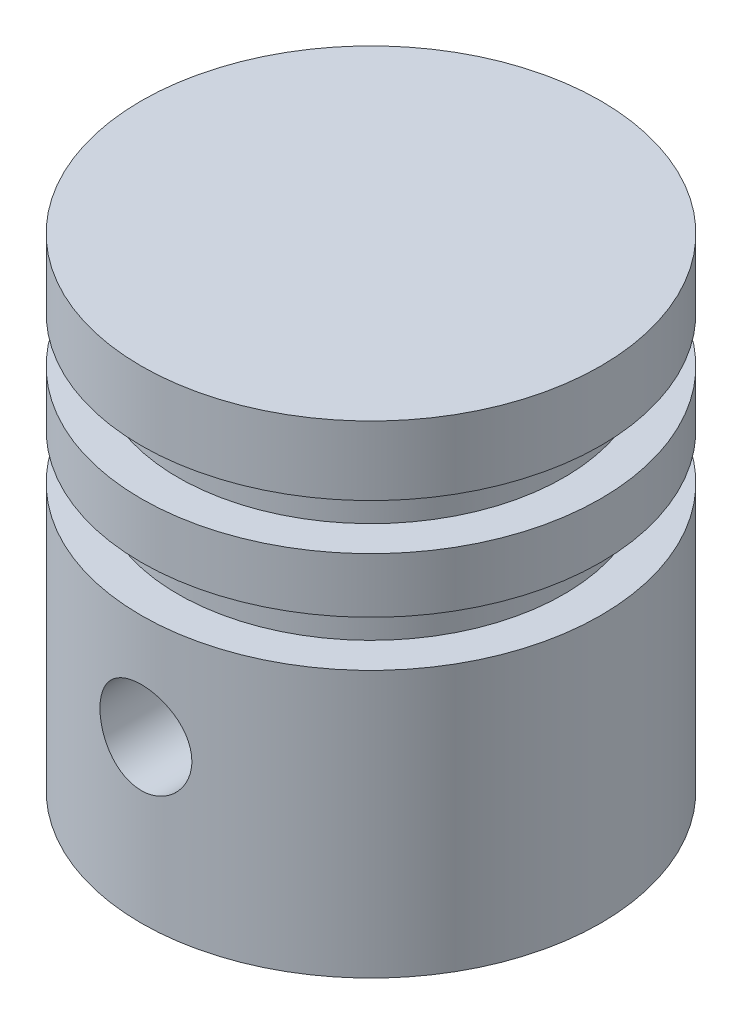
ISO-10303-21;
HEADER;
FILE_DESCRIPTION(('STEP AP214'),'2;1');
FILE_NAME('part.step','',(''),(''),'','','');
FILE_SCHEMA(('AUTOMOTIVE_DESIGN { 1 0 10303 214 1 1 1 1 }'));
ENDSEC;
DATA;
#1=APPLICATION_CONTEXT('core data for automotive mechanical design processes');
#2=APPLICATION_PROTOCOL_DEFINITION('international standard','automotive_design',2000,#1);
#3=PRODUCT_CONTEXT('',#1,'mechanical');
#4=PRODUCT('Part','Part','',(#3));
#5=PRODUCT_RELATED_PRODUCT_CATEGORY('part','',(#4));
#6=PRODUCT_DEFINITION_FORMATION('','',#4);
#7=PRODUCT_DEFINITION_CONTEXT('part definition',#1,'design');
#8=PRODUCT_DEFINITION('design','',#6,#7);
#9=PRODUCT_DEFINITION_SHAPE('','',#8);
#10=(LENGTH_UNIT() NAMED_UNIT(*) SI_UNIT(.MILLI.,.METRE.));
#11=(NAMED_UNIT(*) PLANE_ANGLE_UNIT() SI_UNIT($,.RADIAN.));
#12=(NAMED_UNIT(*) SI_UNIT($,.STERADIAN.) SOLID_ANGLE_UNIT());
#13=UNCERTAINTY_MEASURE_WITH_UNIT(LENGTH_MEASURE(1.E-05),#10,'distance_accuracy_value','');
#14=(GEOMETRIC_REPRESENTATION_CONTEXT(3) GLOBAL_UNCERTAINTY_ASSIGNED_CONTEXT((#13)) GLOBAL_UNIT_ASSIGNED_CONTEXT((#10,
#11,#12)) REPRESENTATION_CONTEXT('',''));
#15=CARTESIAN_POINT('',(0.,0.,0.));
#16=DIRECTION('',(0.,0.,1.));
#17=DIRECTION('',(1.,0.,0.));
#18=AXIS2_PLACEMENT_3D('',#15,#16,#17);
#19=CARTESIAN_POINT('',(0.,35.,-500000.));
#20=DIRECTION('',(0.,0.,1.));
#21=DIRECTION('',(1.,0.,0.));
#22=AXIS2_PLACEMENT_3D('',#19,#20,#21);
#23=CYLINDRICAL_SURFACE('',#22,15.);
#24=CARTESIAN_POINT('',(0.,50.,-35.));
#25=CARTESIAN_POINT('',(-0.400909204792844,49.9999971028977,-34.9999976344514));
#26=CARTESIAN_POINT('',(-0.801939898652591,49.9839057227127,-34.9930930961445));
#27=CARTESIAN_POINT('',(-1.60113278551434,49.9196934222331,-34.9656464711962));
#28=CARTESIAN_POINT('',(-1.99929308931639,49.8715530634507,-34.9450961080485));
#29=CARTESIAN_POINT('',(-2.79051862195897,49.7436069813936,-34.8908380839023));
#30=CARTESIAN_POINT('',(-3.18357029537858,49.6637299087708,-34.8571007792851));
#31=CARTESIAN_POINT('',(-3.96077708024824,49.4731590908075,-34.7773612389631));
#32=CARTESIAN_POINT('',(-4.3449334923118,49.3624698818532,-34.7313608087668));
#33=CARTESIAN_POINT('',(-5.10053886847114,49.1117825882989,-34.6284478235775));
#34=CARTESIAN_POINT('',(-5.47202721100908,48.9718872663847,-34.5715735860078));
#35=CARTESIAN_POINT('',(-6.20141614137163,48.6637911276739,-34.4482114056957));
#36=CARTESIAN_POINT('',(-6.5593162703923,48.4955893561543,-34.3817231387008));
#37=CARTESIAN_POINT('',(-7.25930009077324,48.1323253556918,-34.2407647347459));
#38=CARTESIAN_POINT('',(-7.60139232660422,47.9372778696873,-34.1662989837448));
#39=CARTESIAN_POINT('',(-8.26830646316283,47.5215646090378,-34.0110628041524));
#40=CARTESIAN_POINT('',(-8.59312153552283,47.3008888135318,-33.9302899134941));
#41=CARTESIAN_POINT('',(-9.23882078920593,46.8242471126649,-33.7603451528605));
#42=CARTESIAN_POINT('',(-9.55877529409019,46.5670986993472,-33.6709563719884));
#43=CARTESIAN_POINT('',(-10.1761452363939,46.0278766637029,-33.4895447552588));
#44=CARTESIAN_POINT('',(-10.4735597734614,45.7458020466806,-33.3975218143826));
#45=CARTESIAN_POINT('',(-11.044406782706,45.1581955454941,-33.2131163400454));
#46=CARTESIAN_POINT('',(-11.3178284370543,44.8526531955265,-33.1207336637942));
#47=CARTESIAN_POINT('',(-11.8390649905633,44.2197951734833,-32.9380150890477));
#48=CARTESIAN_POINT('',(-12.0868756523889,43.8924759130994,-32.8476795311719));
#49=CARTESIAN_POINT('',(-12.5677723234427,43.1998851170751,-32.666811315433));
#50=CARTESIAN_POINT('',(-12.7993805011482,42.8335214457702,-32.5765222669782));
#51=CARTESIAN_POINT('',(-13.2306201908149,42.0808697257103,-32.4037752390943));
#52=CARTESIAN_POINT('',(-13.4302649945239,41.6945900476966,-32.3213140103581));
#53=CARTESIAN_POINT('',(-13.7958991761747,40.9044569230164,-32.1669483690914));
#54=CARTESIAN_POINT('',(-13.9618951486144,40.5006069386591,-32.095041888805));
#55=CARTESIAN_POINT('',(-14.2585659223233,39.6780755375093,-31.964349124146));
#56=CARTESIAN_POINT('',(-14.3892435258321,39.2593953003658,-31.9055617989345));
#57=CARTESIAN_POINT('',(-14.6081295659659,38.431692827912,-31.8059159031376));
#58=CARTESIAN_POINT('',(-14.6981369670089,38.0232368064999,-31.7643069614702));
#59=CARTESIAN_POINT('',(-14.8438411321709,37.1989782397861,-31.6964803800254));
#60=CARTESIAN_POINT('',(-14.8995390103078,36.7831759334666,-31.6702622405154));
#61=CARTESIAN_POINT('',(-14.9758921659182,35.9478700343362,-31.6342290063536));
#62=CARTESIAN_POINT('',(-14.9965654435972,35.5283684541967,-31.6244054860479));
#63=CARTESIAN_POINT('',(-15.0026465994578,34.6890638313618,-31.6215214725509));
#64=CARTESIAN_POINT('',(-14.9880565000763,34.2692608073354,-31.6284600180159));
#65=CARTESIAN_POINT('',(-14.9264580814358,33.4673356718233,-31.6575718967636));
#66=CARTESIAN_POINT('',(-14.8822103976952,33.0849502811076,-31.6784473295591));
#67=CARTESIAN_POINT('',(-14.7646697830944,32.3256602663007,-31.7334008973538));
#68=CARTESIAN_POINT('',(-14.6913786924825,31.9487552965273,-31.7674781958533));
#69=CARTESIAN_POINT('',(-14.5164883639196,31.2028505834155,-31.847775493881));
#70=CARTESIAN_POINT('',(-14.4148848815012,30.8338520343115,-31.8939973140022));
#71=CARTESIAN_POINT('',(-14.1843225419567,30.1060522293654,-31.9972018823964));
#72=CARTESIAN_POINT('',(-14.055362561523,29.7472513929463,-32.0541850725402));
#73=CARTESIAN_POINT('',(-13.7680995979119,29.0342361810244,-32.1786333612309));
#74=CARTESIAN_POINT('',(-13.6092234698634,28.6802878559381,-32.2462981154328));
#75=CARTESIAN_POINT('',(-13.2652122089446,27.9868689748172,-32.3893322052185));
#76=CARTESIAN_POINT('',(-13.0800675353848,27.6474037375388,-32.4647043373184));
#77=CARTESIAN_POINT('',(-12.6847793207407,26.9846859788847,-32.6211825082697));
#78=CARTESIAN_POINT('',(-12.4746322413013,26.6614357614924,-32.7022893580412));
#79=CARTESIAN_POINT('',(-12.0305981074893,26.0326783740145,-32.8682351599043));
#80=CARTESIAN_POINT('',(-11.7967096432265,25.7271722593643,-32.9530743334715));
#81=CARTESIAN_POINT('',(-11.2843030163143,25.1085888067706,-33.1322296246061));
#82=CARTESIAN_POINT('',(-11.003662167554,24.7973144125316,-33.2267102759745));
#83=CARTESIAN_POINT('',(-10.4173746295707,24.1993719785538,-33.4151623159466));
#84=CARTESIAN_POINT('',(-10.1117375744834,23.9126945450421,-33.5091338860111));
#85=CARTESIAN_POINT('',(-9.476813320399,23.3653188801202,-33.6942043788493));
#86=CARTESIAN_POINT('',(-9.14751000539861,23.1046386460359,-33.7853012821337));
#87=CARTESIAN_POINT('',(-8.46738737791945,22.6113050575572,-33.9621369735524));
#88=CARTESIAN_POINT('',(-8.11657688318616,22.3786403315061,-34.0478779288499));
#89=CARTESIAN_POINT('',(-7.38591865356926,21.9372643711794,-34.2139175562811));
#90=CARTESIAN_POINT('',(-7.0055528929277,21.7293338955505,-34.2940165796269));
#91=CARTESIAN_POINT('',(-6.22657729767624,21.3464998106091,-34.4439695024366));
#92=CARTESIAN_POINT('',(-5.82796695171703,21.1715971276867,-34.5138231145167));
#93=CARTESIAN_POINT('',(-5.01550295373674,20.8566463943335,-34.641214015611));
#94=CARTESIAN_POINT('',(-4.60165660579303,20.7165818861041,-34.6987571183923));
#95=CARTESIAN_POINT('',(-3.76173750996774,20.4727666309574,-34.799830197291));
#96=CARTESIAN_POINT('',(-3.33566575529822,20.3690129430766,-34.8433613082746));
#97=CARTESIAN_POINT('',(-2.50331586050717,20.2046870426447,-34.9126929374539));
#98=CARTESIAN_POINT('',(-2.09759255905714,20.1417125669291,-34.9394757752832));
#99=CARTESIAN_POINT('',(-1.28167061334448,20.0492186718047,-34.9789093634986));
#100=CARTESIAN_POINT('',(-0.871472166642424,20.0196977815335,-34.9915607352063));
#101=CARTESIAN_POINT('',(-0.0499567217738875,19.994456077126,-35.0023744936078));
#102=CARTESIAN_POINT('',(0.36135994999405,19.9987262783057,-35.0005407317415));
#103=CARTESIAN_POINT('',(1.1819301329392,20.0409957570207,-34.9824447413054));
#104=CARTESIAN_POINT('',(1.59118369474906,20.078994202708,-34.9661828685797));
#105=CARTESIAN_POINT('',(2.38273124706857,20.1853626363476,-34.9209294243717));
#106=CARTESIAN_POINT('',(2.76530029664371,20.2520074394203,-34.8926618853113));
#107=CARTESIAN_POINT('',(3.5230958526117,20.4144609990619,-34.824309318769));
#108=CARTESIAN_POINT('',(3.89832268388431,20.5102684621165,-34.7842248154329));
#109=CARTESIAN_POINT('',(4.63906200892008,20.7301581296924,-34.6932036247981));
#110=CARTESIAN_POINT('',(5.00457380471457,20.8542423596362,-34.6422661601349));
#111=CARTESIAN_POINT('',(5.7236807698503,21.1296095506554,-34.5307383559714));
#112=CARTESIAN_POINT('',(6.07727549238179,21.2808935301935,-34.4701476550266));
#113=CARTESIAN_POINT('',(6.78140001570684,21.6145937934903,-34.3386787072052));
#114=CARTESIAN_POINT('',(7.13149030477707,21.7978338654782,-34.2675385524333));
#115=CARTESIAN_POINT('',(7.81500404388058,22.1905858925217,-34.1181493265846));
#116=CARTESIAN_POINT('',(8.14842727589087,22.4000981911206,-34.0399001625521));
#117=CARTESIAN_POINT('',(8.79698186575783,22.8440316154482,-33.8780879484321));
#118=CARTESIAN_POINT('',(9.1121096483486,23.0784575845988,-33.7945238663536));
#119=CARTESIAN_POINT('',(9.72258320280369,23.5708605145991,-33.6239776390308));
#120=CARTESIAN_POINT('',(10.0179218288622,23.8288459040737,-33.5369942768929));
#121=CARTESIAN_POINT('',(10.6087326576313,24.3871693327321,-33.3550203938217));
#122=CARTESIAN_POINT('',(10.9025420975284,24.6892335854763,-33.259919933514));
#123=CARTESIAN_POINT('',(11.4638688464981,25.3171759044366,-33.070643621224));
#124=CARTESIAN_POINT('',(11.7313844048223,25.6430555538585,-32.976467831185));
#125=CARTESIAN_POINT('',(12.238599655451,26.3169925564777,-32.7916084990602));
#126=CARTESIAN_POINT('',(12.4782858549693,26.6650605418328,-32.7009266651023));
#127=CARTESIAN_POINT('',(12.9279614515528,27.3811750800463,-32.5257749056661));
#128=CARTESIAN_POINT('',(13.1379626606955,27.7492136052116,-32.4413025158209));
#129=CARTESIAN_POINT('',(13.5302911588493,28.5101787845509,-32.279669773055));
#130=CARTESIAN_POINT('',(13.7120429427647,28.9034372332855,-32.2026711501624));
#131=CARTESIAN_POINT('',(14.0414553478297,29.7060696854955,-32.0604079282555));
#132=CARTESIAN_POINT('',(14.1891152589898,30.1154440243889,-31.9951435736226));
#133=CARTESIAN_POINT('',(14.4486344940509,30.9470345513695,-31.8787892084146));
#134=CARTESIAN_POINT('',(14.5605203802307,31.3692409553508,-31.8276886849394));
#135=CARTESIAN_POINT('',(14.7472499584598,32.2233728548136,-31.741601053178));
#136=CARTESIAN_POINT('',(14.8220974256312,32.6552973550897,-31.7066123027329));
#137=CARTESIAN_POINT('',(14.9292560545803,33.4900684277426,-31.6562869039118));
#138=CARTESIAN_POINT('',(14.9645051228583,33.8924584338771,-31.6395955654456));
#139=CARTESIAN_POINT('',(15.0024151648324,34.6991068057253,-31.6216381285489));
#140=CARTESIAN_POINT('',(15.0050779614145,35.1033650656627,-31.6203711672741));
#141=CARTESIAN_POINT('',(14.9777864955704,35.9104588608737,-31.6333072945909));
#142=CARTESIAN_POINT('',(14.9478373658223,36.3132946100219,-31.6475079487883));
#143=CARTESIAN_POINT('',(14.8556968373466,37.1144377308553,-31.6908639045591));
#144=CARTESIAN_POINT('',(14.7935057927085,37.5127451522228,-31.7200190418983));
#145=CARTESIAN_POINT('',(14.6416840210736,38.281220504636,-31.7903708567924));
#146=CARTESIAN_POINT('',(14.5536552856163,38.6517719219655,-31.8308594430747));
#147=CARTESIAN_POINT('',(14.3501466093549,39.3837887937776,-31.9231226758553));
#148=CARTESIAN_POINT('',(14.2346679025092,39.7452546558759,-31.9748968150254));
#149=CARTESIAN_POINT('',(13.9772602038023,40.4570545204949,-32.0882525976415));
#150=CARTESIAN_POINT('',(13.8353301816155,40.8073880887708,-32.1498346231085));
#151=CARTESIAN_POINT('',(13.5260653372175,41.4952146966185,-32.2811675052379));
#152=CARTESIAN_POINT('',(13.3587205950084,41.8327026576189,-32.3509215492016));
#153=CARTESIAN_POINT('',(12.9887122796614,42.5134926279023,-32.5013175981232));
#154=CARTESIAN_POINT('',(12.7845057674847,42.8558665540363,-32.582365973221));
#155=CARTESIAN_POINT('',(12.3501430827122,43.5224553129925,-32.7494748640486));
#156=CARTESIAN_POINT('',(12.1199852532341,43.8466689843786,-32.8355356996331));
#157=CARTESIAN_POINT('',(11.6350326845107,44.4754248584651,-33.0104901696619));
#158=CARTESIAN_POINT('',(11.3802321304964,44.7799623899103,-33.0993844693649));
#159=CARTESIAN_POINT('',(10.8473698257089,45.3678342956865,-33.2778233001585));
#160=CARTESIAN_POINT('',(10.5693042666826,45.6511651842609,-33.3673679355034));
#161=CARTESIAN_POINT('',(9.96843693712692,46.2166689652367,-33.5519996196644));
#162=CARTESIAN_POINT('',(9.64383628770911,46.496974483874,-33.646964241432));
#163=CARTESIAN_POINT('',(8.97117604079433,47.0292091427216,-33.8325238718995));
#164=CARTESIAN_POINT('',(8.62312487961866,47.2811484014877,-33.9231204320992));
#165=CARTESIAN_POINT('',(7.90520949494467,47.7551085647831,-34.0975687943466));
#166=CARTESIAN_POINT('',(7.53532936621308,47.9771072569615,-34.1814155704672));
#167=CARTESIAN_POINT('',(6.77629852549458,48.3891080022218,-34.3399483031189));
#168=CARTESIAN_POINT('',(6.38714935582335,48.5791126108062,-34.4146349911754));
#169=CARTESIAN_POINT('',(5.59795361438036,48.9228390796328,-34.5517143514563));
#170=CARTESIAN_POINT('',(5.19814818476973,49.077048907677,-34.6142701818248));
#171=CARTESIAN_POINT('',(4.38509183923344,49.3511327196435,-34.7266377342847));
#172=CARTESIAN_POINT('',(3.97183874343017,49.4710011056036,-34.7764473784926));
#173=CARTESIAN_POINT('',(3.13633541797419,49.6747337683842,-34.8617164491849));
#174=CARTESIAN_POINT('',(2.71411336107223,49.7586971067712,-34.8972153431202));
#175=CARTESIAN_POINT('',(1.86323610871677,49.8900443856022,-34.9529662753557));
#176=CARTESIAN_POINT('',(1.43458575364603,49.9374545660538,-34.9732292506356));
#177=CARTESIAN_POINT('',(0.837465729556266,49.9775419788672,-34.9903801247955));
#178=CARTESIAN_POINT('',(0.670111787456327,49.9859610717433,-34.9939852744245));
#179=CARTESIAN_POINT('',(0.335178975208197,49.9971907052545,-34.9987957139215));
#180=CARTESIAN_POINT('',(0.167600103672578,50.0000012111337,-35.0000009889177));
#181=CARTESIAN_POINT('',(0.,50.,-35.));
#182=B_SPLINE_CURVE_WITH_KNOTS('',3,(#24,#25,#26,#27,#28,#29,#30,#31,#32,#33,#34,#35,#36,#37,
#38,#39,#40,#41,#42,#43,#44,#45,#46,#47,#48,#49,#50,#51,#52,#53,#54,#55,#56,#57,#58,#59,#60,#61,
#62,#63,#64,#65,#66,#67,#68,#69,#70,#71,#72,#73,#74,#75,#76,#77,#78,#79,#80,#81,#82,#83,#84,#85,
#86,#87,#88,#89,#90,#91,#92,#93,#94,#95,#96,#97,#98,#99,#100,#101,#102,#103,#104,#105,#106,#107,
#108,#109,#110,#111,#112,#113,#114,#115,#116,#117,#118,#119,#120,#121,#122,#123,#124,#125,#126,
#127,#128,#129,#130,#131,#132,#133,#134,#135,#136,#137,#138,#139,#140,#141,#142,#143,#144,#145,
#146,#147,#148,#149,#150,#151,#152,#153,#154,#155,#156,#157,#158,#159,#160,#161,#162,#163,#164,
#165,#166,#167,#168,#169,#170,#171,#172,#173,#174,#175,#176,#177,#178,#179,#180,#181),
.UNSPECIFIED.,.T.,.F.,(4,2,2,2,2,2,2,2,2,2,2,2,2,2,2,2,2,2,2,2,2,2,2,2,2,2,2,2,2,2,2,2,2,2,2,2,
2,2,2,2,2,2,2,2,2,2,2,2,2,2,2,2,2,2,2,2,2,2,2,2,2,2,2,2,2,2,2,2,2,2,2,2,2,2,2,2,2,2,4),(0.,
1.2025581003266,2.40584624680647,3.61185503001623,4.81768634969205,6.01934433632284,
7.22104286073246,8.4220840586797,9.62359646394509,10.8825284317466,12.14151066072,
13.4010576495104,14.6608126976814,15.9873754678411,17.3133851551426,18.6391347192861,
19.9647790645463,21.2240419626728,22.483263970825,23.7418386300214,25.0003411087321,
26.1554931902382,27.3105720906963,28.4658242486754,29.6211238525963,30.8013538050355,
31.9820135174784,33.1628405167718,34.3437376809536,35.6311581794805,36.9180847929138,
38.205896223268,39.4931831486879,40.813964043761,42.1347819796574,43.4549747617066,
44.7750605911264,46.0078309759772,47.2405471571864,48.4729355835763,49.7052936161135,
50.8720230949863,52.0387008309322,53.2054621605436,54.3722671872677,55.5754618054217,
56.7786721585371,57.9821168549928,59.1859937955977,60.480474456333,61.7750412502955,
63.0702331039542,64.3649081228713,65.6832297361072,67.0015788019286,68.318946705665,
69.6361803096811,70.8474299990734,72.0586119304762,73.2696032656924,74.4805813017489,
75.6283398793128,76.7760468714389,77.9237985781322,79.0719994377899,80.2911093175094,
81.5102970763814,82.7297732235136,83.949449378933,85.2656822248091,86.5814440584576,
87.898176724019,89.2148041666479,90.5122627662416,91.8099327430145,93.1039989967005,
94.3971354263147,94.8998617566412,95.402591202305),.UNSPECIFIED.);
#183=CARTESIAN_POINT('',(0.,50.,-35.));
#184=VERTEX_POINT('',#183);
#185=EDGE_CURVE('E11',#184,#184,#182,.T.);
#186=ORIENTED_EDGE('',*,*,#185,.T.);
#187=EDGE_LOOP('',(#186));
#188=FACE_BOUND('',#187,.T.);
#189=CARTESIAN_POINT('',(0.,35.,-10.));
#190=DIRECTION('',(0.,0.,1.));
#191=DIRECTION('',(1.,0.,0.));
#192=AXIS2_PLACEMENT_3D('',#189,#190,#191);
#193=CIRCLE('',#192,15.);
#194=CARTESIAN_POINT('',(15.,35.,-10.));
#195=VERTEX_POINT('',#194);
#196=EDGE_CURVE('E91',#195,#195,#193,.T.);
#197=ORIENTED_EDGE('',*,*,#196,.F.);
#198=EDGE_LOOP('',(#197));
#199=FACE_BOUND('',#198,.T.);
#200=ADVANCED_FACE('F37',(#188,#199),#23,.T.);
#201=CARTESIAN_POINT('',(0.,35.,-500000.));
#202=DIRECTION('',(0.,0.,1.));
#203=DIRECTION('',(1.,0.,0.));
#204=AXIS2_PLACEMENT_3D('',#201,#202,#203);
#205=CYLINDRICAL_SURFACE('',#204,10.);
#206=CARTESIAN_POINT('',(0.,45.,-50.));
#207=CARTESIAN_POINT('',(0.277977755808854,45.0000055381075,-50.0000028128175));
#208=CARTESIAN_POINT('',(0.55588614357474,44.988406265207,-49.9976778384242));
#209=CARTESIAN_POINT('',(1.10977921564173,44.9421120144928,-49.9884489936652));
#210=CARTESIAN_POINT('',(1.38576356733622,44.9074131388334,-49.9815443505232));
#211=CARTESIAN_POINT('',(1.93392208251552,44.8151548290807,-49.963338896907));
#212=CARTESIAN_POINT('',(2.20609347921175,44.7575796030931,-49.9520350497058));
#213=CARTESIAN_POINT('',(2.74451501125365,44.620022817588,-49.9253471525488));
#214=CARTESIAN_POINT('',(3.01076503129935,44.5400408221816,-49.9099630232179));
#215=CARTESIAN_POINT('',(3.53521359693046,44.3583761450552,-49.875557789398));
#216=CARTESIAN_POINT('',(3.79341984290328,44.2567149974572,-49.8565402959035));
#217=CARTESIAN_POINT('',(4.30028962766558,44.0324038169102,-49.8153808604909));
#218=CARTESIAN_POINT('',(4.54895307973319,43.9097535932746,-49.7932388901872));
#219=CARTESIAN_POINT('',(5.03500105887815,43.6443861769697,-49.7464407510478));
#220=CARTESIAN_POINT('',(5.27238832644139,43.5016738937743,-49.7217851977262));
#221=CARTESIAN_POINT('',(5.73445047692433,43.1971134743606,-49.6706164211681));
#222=CARTESIAN_POINT('',(5.95912114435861,43.0352590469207,-49.6441025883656));
#223=CARTESIAN_POINT('',(6.39679707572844,42.6915109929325,-49.5896179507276));
#224=CARTESIAN_POINT('',(6.60963041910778,42.509400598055,-49.5616335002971));
#225=CARTESIAN_POINT('',(7.01925151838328,42.1280027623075,-49.5052811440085));
#226=CARTESIAN_POINT('',(7.21603915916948,41.9287151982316,-49.4769132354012));
#227=CARTESIAN_POINT('',(7.59228605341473,41.514257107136,-49.4205766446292));
#228=CARTESIAN_POINT('',(7.77174091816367,41.2990825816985,-49.3926080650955));
#229=CARTESIAN_POINT('',(8.11197405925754,40.8544189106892,-49.3378715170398));
#230=CARTESIAN_POINT('',(8.27275884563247,40.6249347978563,-49.3111031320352));
#231=CARTESIAN_POINT('',(8.57600136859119,40.1509311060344,-49.2592741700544));
#232=CARTESIAN_POINT('',(8.71827477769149,39.9062915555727,-49.2342317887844));
#233=CARTESIAN_POINT('',(8.98167482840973,39.4056246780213,-49.1868624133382));
#234=CARTESIAN_POINT('',(9.10280130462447,39.1495972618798,-49.1645354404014));
#235=CARTESIAN_POINT('',(9.32297805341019,38.6279765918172,-49.1232596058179));
#236=CARTESIAN_POINT('',(9.42203002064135,38.3623840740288,-49.1043104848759));
#237=CARTESIAN_POINT('',(9.59729126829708,37.8235206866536,-49.0703574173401));
#238=CARTESIAN_POINT('',(9.67350088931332,37.55024993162,-49.0553534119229));
#239=CARTESIAN_POINT('',(9.80161813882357,37.0016455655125,-49.0299142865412));
#240=CARTESIAN_POINT('',(9.85383113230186,36.7263859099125,-49.019421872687));
#241=CARTESIAN_POINT('',(9.93499133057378,36.1723216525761,-49.0030373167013));
#242=CARTESIAN_POINT('',(9.96393871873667,35.8935170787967,-48.9971451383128));
#243=CARTESIAN_POINT('',(9.99832951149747,35.3344271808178,-48.9901389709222));
#244=CARTESIAN_POINT('',(10.0037750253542,35.054141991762,-48.9890245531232));
#245=CARTESIAN_POINT('',(9.99112280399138,34.4941271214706,-48.9916064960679));
#246=CARTESIAN_POINT('',(9.97302526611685,34.2143974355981,-48.9953028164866));
#247=CARTESIAN_POINT('',(9.91388721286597,33.6617546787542,-49.0073028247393));
#248=CARTESIAN_POINT('',(9.87319735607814,33.3888024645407,-49.015536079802));
#249=CARTESIAN_POINT('',(9.76944726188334,32.8473547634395,-49.0363201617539));
#250=CARTESIAN_POINT('',(9.70638728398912,32.5788592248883,-49.0488709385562));
#251=CARTESIAN_POINT('',(9.55839501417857,32.0482306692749,-49.0779254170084));
#252=CARTESIAN_POINT('',(9.47346596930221,31.7860967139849,-49.0944285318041));
#253=CARTESIAN_POINT('',(9.28233469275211,31.2698452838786,-49.1309243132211));
#254=CARTESIAN_POINT('',(9.17612453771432,31.0157308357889,-49.1509182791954));
#255=CARTESIAN_POINT('',(8.94246310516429,30.515692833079,-49.193968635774));
#256=CARTESIAN_POINT('',(8.81487730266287,30.2698338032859,-49.2170442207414));
#257=CARTESIAN_POINT('',(8.53986851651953,29.7897035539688,-49.2655065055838));
#258=CARTESIAN_POINT('',(8.39244480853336,29.555432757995,-49.2908932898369));
#259=CARTESIAN_POINT('',(8.07877597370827,29.1000141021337,-49.3432736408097));
#260=CARTESIAN_POINT('',(7.91252934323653,28.8788672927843,-49.3702673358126));
#261=CARTESIAN_POINT('',(7.56234993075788,28.4511638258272,-49.4251177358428));
#262=CARTESIAN_POINT('',(7.37841694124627,28.2446073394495,-49.452974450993));
#263=CARTESIAN_POINT('',(6.99062034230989,27.8438581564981,-49.5092950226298));
#264=CARTESIAN_POINT('',(6.78645727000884,27.6499553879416,-49.5377607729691));
#265=CARTESIAN_POINT('',(6.36246248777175,27.2800111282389,-49.593999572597));
#266=CARTESIAN_POINT('',(6.14263106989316,27.1039693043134,-49.6217726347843));
#267=CARTESIAN_POINT('',(5.68873593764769,26.7709336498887,-49.6758545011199));
#268=CARTESIAN_POINT('',(5.45466905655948,26.613944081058,-49.7021629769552));
#269=CARTESIAN_POINT('',(4.97403719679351,26.3202396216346,-49.7525608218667));
#270=CARTESIAN_POINT('',(4.72747701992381,26.1835170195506,-49.7766510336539));
#271=CARTESIAN_POINT('',(4.22303258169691,25.9310593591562,-49.8219853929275));
#272=CARTESIAN_POINT('',(3.96512908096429,25.8153618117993,-49.8432244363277));
#273=CARTESIAN_POINT('',(3.44022135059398,25.606134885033,-49.8822025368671));
#274=CARTESIAN_POINT('',(3.1732170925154,25.5126055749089,-49.8999415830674));
#275=CARTESIAN_POINT('',(2.63205201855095,25.3484589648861,-49.9314104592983));
#276=CARTESIAN_POINT('',(2.35789191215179,25.2778394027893,-49.9451406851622));
#277=CARTESIAN_POINT('',(1.80439488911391,25.1600705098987,-49.9681986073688));
#278=CARTESIAN_POINT('',(1.52505805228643,25.1129208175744,-49.977526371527));
#279=CARTESIAN_POINT('',(0.967980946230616,25.0430680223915,-49.9913926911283));
#280=CARTESIAN_POINT('',(0.690292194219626,25.0199689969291,-49.996008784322));
#281=CARTESIAN_POINT('',(0.133918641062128,24.9970213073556,-50.0005945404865));
#282=CARTESIAN_POINT('',(-0.14476614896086,24.9971723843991,-50.0005642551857));
#283=CARTESIAN_POINT('',(-0.701096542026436,25.0207227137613,-49.995858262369));
#284=CARTESIAN_POINT('',(-0.978742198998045,25.0441207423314,-49.991182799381));
#285=CARTESIAN_POINT('',(-1.53100232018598,25.1139745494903,-49.977318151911));
#286=CARTESIAN_POINT('',(-1.80561679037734,25.1604302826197,-49.968128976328));
#287=CARTESIAN_POINT('',(-2.34739156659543,25.275507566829,-49.9455964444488));
#288=CARTESIAN_POINT('',(-2.61459675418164,25.3439255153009,-49.9322912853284));
#289=CARTESIAN_POINT('',(-3.14224372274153,25.5025163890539,-49.9018651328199));
#290=CARTESIAN_POINT('',(-3.40268555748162,25.5926891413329,-49.8847441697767));
#291=CARTESIAN_POINT('',(-3.91499921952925,25.7941034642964,-49.8471538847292));
#292=CARTESIAN_POINT('',(-4.16687213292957,25.9053423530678,-49.8266849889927));
#293=CARTESIAN_POINT('',(-4.6604901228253,26.148134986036,-49.7829414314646));
#294=CARTESIAN_POINT('',(-4.90223131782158,26.2796964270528,-49.75966570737));
#295=CARTESIAN_POINT('',(-5.37668428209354,26.563849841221,-49.7106509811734));
#296=CARTESIAN_POINT('',(-5.60925542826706,26.7166721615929,-49.6848860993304));
#297=CARTESIAN_POINT('',(-6.06084706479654,27.0411387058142,-49.6318230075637));
#298=CARTESIAN_POINT('',(-6.27986136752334,27.2127914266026,-49.6045241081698));
#299=CARTESIAN_POINT('',(-6.70279490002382,27.5737067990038,-49.5491477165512));
#300=CARTESIAN_POINT('',(-6.9067126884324,27.7629711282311,-49.5210701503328));
#301=CARTESIAN_POINT('',(-7.29798916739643,28.1577375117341,-49.4649210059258));
#302=CARTESIAN_POINT('',(-7.48535510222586,28.3632323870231,-49.4368494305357));
#303=CARTESIAN_POINT('',(-7.84517391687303,28.7925121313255,-49.3810380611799));
#304=CARTESIAN_POINT('',(-8.01734702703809,29.0165331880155,-49.3533103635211));
#305=CARTESIAN_POINT('',(-8.34214485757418,29.4783798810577,-49.2994494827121));
#306=CARTESIAN_POINT('',(-8.4947768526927,29.7162003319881,-49.2733157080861));
#307=CARTESIAN_POINT('',(-8.77948955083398,30.2041310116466,-49.2233833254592));
#308=CARTESIAN_POINT('',(-8.91156681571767,30.4542432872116,-49.1995851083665));
#309=CARTESIAN_POINT('',(-9.15415330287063,30.964978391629,-49.1550271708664));
#310=CARTESIAN_POINT('',(-9.26466273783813,31.2256011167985,-49.1342674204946));
#311=CARTESIAN_POINT('',(-9.46274286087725,31.754122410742,-49.0965031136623));
#312=CARTESIAN_POINT('',(-9.5504308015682,32.0219756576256,-49.0794794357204));
#313=CARTESIAN_POINT('',(-9.70293434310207,32.564344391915,-49.049557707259));
#314=CARTESIAN_POINT('',(-9.76774998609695,32.8388598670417,-49.0366596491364));
#315=CARTESIAN_POINT('',(-9.87397956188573,33.3925249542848,-49.0153799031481));
#316=CARTESIAN_POINT('',(-9.91539605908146,33.6716740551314,-49.006997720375));
#317=CARTESIAN_POINT('',(-9.97449643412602,34.2325739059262,-48.9950031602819));
#318=CARTESIAN_POINT('',(-9.99218064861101,34.5143246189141,-48.9913907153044));
#319=CARTESIAN_POINT('',(-10.0035662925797,35.0732067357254,-48.9890670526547));
#320=CARTESIAN_POINT('',(-9.99769739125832,35.3503291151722,-48.9902680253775));
#321=CARTESIAN_POINT('',(-9.96298881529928,35.9030687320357,-48.9973383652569));
#322=CARTESIAN_POINT('',(-9.9341494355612,36.1786859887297,-49.0032076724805));
#323=CARTESIAN_POINT('',(-9.85373138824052,36.7264426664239,-49.0194416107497));
#324=CARTESIAN_POINT('',(-9.80215303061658,36.9985821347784,-49.0298061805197));
#325=CARTESIAN_POINT('',(-9.67666303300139,37.5374651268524,-49.0547273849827));
#326=CARTESIAN_POINT('',(-9.60275130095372,37.8042086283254,-49.0692840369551));
#327=CARTESIAN_POINT('',(-9.43338650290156,38.3297507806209,-49.1021245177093));
#328=CARTESIAN_POINT('',(-9.33799053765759,38.5885684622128,-49.1203984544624));
#329=CARTESIAN_POINT('',(-9.12621961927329,39.0973240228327,-49.1601842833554));
#330=CARTESIAN_POINT('',(-9.00983703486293,39.3472586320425,-49.1816973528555));
#331=CARTESIAN_POINT('',(-8.75697253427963,39.8364485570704,-49.2273493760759));
#332=CARTESIAN_POINT('',(-8.62049329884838,40.0757052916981,-49.2514879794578));
#333=CARTESIAN_POINT('',(-8.3283733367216,40.5420119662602,-49.3017256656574));
#334=CARTESIAN_POINT('',(-8.17273187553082,40.7690614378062,-49.3278248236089));
#335=CARTESIAN_POINT('',(-7.84054768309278,41.2132129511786,-49.3817232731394));
#336=CARTESIAN_POINT('',(-7.66369484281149,41.4300805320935,-49.4095439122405));
#337=CARTESIAN_POINT('',(-7.29248007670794,41.8482036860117,-49.465694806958));
#338=CARTESIAN_POINT('',(-7.09811796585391,42.0494590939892,-49.4940250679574));
#339=CARTESIAN_POINT('',(-6.69314940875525,42.4350479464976,-49.5504141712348));
#340=CARTESIAN_POINT('',(-6.48253910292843,42.6193773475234,-49.5784729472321));
#341=CARTESIAN_POINT('',(-6.0465335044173,42.9697964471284,-49.6335340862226));
#342=CARTESIAN_POINT('',(-5.82113854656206,43.1358865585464,-49.6605364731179));
#343=CARTESIAN_POINT('',(-5.35458685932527,43.4503478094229,-49.7130171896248));
#344=CARTESIAN_POINT('',(-5.11328734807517,43.598510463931,-49.7384761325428));
#345=CARTESIAN_POINT('',(-4.61888962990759,43.873888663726,-49.7868208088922));
#346=CARTESIAN_POINT('',(-4.36579579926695,44.0011119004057,-49.8097074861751));
#347=CARTESIAN_POINT('',(-3.84964665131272,44.2336490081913,-49.8522536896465));
#348=CARTESIAN_POINT('',(-3.58659747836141,44.3389761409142,-49.8719151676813));
#349=CARTESIAN_POINT('',(-3.05236884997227,44.5269753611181,-49.907462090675));
#350=CARTESIAN_POINT('',(-2.78119097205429,44.6096518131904,-49.9233482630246));
#351=CARTESIAN_POINT('',(-2.09840431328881,44.7864462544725,-49.957617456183));
#352=CARTESIAN_POINT('',(-1.68291498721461,44.8664196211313,-49.97342838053));
#353=CARTESIAN_POINT('',(-0.844896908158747,44.9731914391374,-49.9946173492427));
#354=CARTESIAN_POINT('',(-0.422368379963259,44.9999915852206,-49.9999957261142));
#355=CARTESIAN_POINT('',(0.,45.,-50.));
#356=B_SPLINE_CURVE_WITH_KNOTS('',3,(#206,#207,#208,#209,#210,#211,#212,#213,#214,#215,#216,
#217,#218,#219,#220,#221,#222,#223,#224,#225,#226,#227,#228,#229,#230,#231,#232,#233,#234,#235,
#236,#237,#238,#239,#240,#241,#242,#243,#244,#245,#246,#247,#248,#249,#250,#251,#252,#253,#254,
#255,#256,#257,#258,#259,#260,#261,#262,#263,#264,#265,#266,#267,#268,#269,#270,#271,#272,#273,
#274,#275,#276,#277,#278,#279,#280,#281,#282,#283,#284,#285,#286,#287,#288,#289,#290,#291,#292,
#293,#294,#295,#296,#297,#298,#299,#300,#301,#302,#303,#304,#305,#306,#307,#308,#309,#310,#311,
#312,#313,#314,#315,#316,#317,#318,#319,#320,#321,#322,#323,#324,#325,#326,#327,#328,#329,#330,
#331,#332,#333,#334,#335,#336,#337,#338,#339,#340,#341,#342,#343,#344,#345,#346,#347,#348,#349,
#350,#351,#352,#353,#354,#355),.UNSPECIFIED.,.T.,.F.,(4,2,2,2,2,2,2,2,2,2,2,2,2,2,2,2,2,2,2,2,2,
2,2,2,2,2,2,2,2,2,2,2,2,2,2,2,2,2,2,2,2,2,2,2,2,2,2,2,2,2,2,2,2,2,2,2,2,2,2,2,2,2,2,2,2,2,2,2,2,
2,2,2,2,2,4),(0.,0.833562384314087,1.66726546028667,2.50154505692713,3.33584088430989,
4.16931182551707,5.00279033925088,5.83606524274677,6.66961477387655,7.51314652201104,
8.35668432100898,9.20043514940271,10.0438908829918,10.8951899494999,11.7464956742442,
12.5977360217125,13.448963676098,14.2890369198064,15.1291035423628,15.9690947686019,
16.8090789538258,17.6363760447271,18.4636635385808,19.2908282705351,20.1183015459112,
20.9511927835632,21.7841144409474,22.6171026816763,23.4501006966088,24.2981118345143,
25.1461071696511,25.9942918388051,26.8421529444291,27.6915121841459,28.5408740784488,
29.3901520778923,30.2394169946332,31.0744689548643,31.9095116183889,32.7445103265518,
33.5795073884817,34.4069768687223,35.234439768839,36.061797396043,36.8894691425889,
37.7269307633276,38.564771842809,39.4026928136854,40.2402452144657,41.0909250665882,
41.9412873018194,42.7917916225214,43.6422875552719,44.4883234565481,45.3343577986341,
46.1802994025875,47.0262290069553,47.8567974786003,48.6873552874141,49.5179017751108,
50.3484516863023,51.1768196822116,52.0054895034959,52.8340488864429,53.6626400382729,
54.5053049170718,55.3479787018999,56.1908532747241,57.0337087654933,57.8855779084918,
58.7371334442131,59.5881717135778,60.4390458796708,61.7056278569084,62.9721694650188),.UNSPECIFIED.);
#357=CARTESIAN_POINT('',(0.,45.,-50.));
#358=VERTEX_POINT('',#357);
#359=EDGE_CURVE('E105',#358,#358,#356,.T.);
#360=ORIENTED_EDGE('',*,*,#359,.T.);
#361=EDGE_LOOP('',(#360));
#362=FACE_BOUND('',#361,.T.);
#363=CARTESIAN_POINT('',(0.,35.,-9.99999999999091));
#364=DIRECTION('',(0.,0.,1.));
#365=DIRECTION('',(1.,0.,0.));
#366=AXIS2_PLACEMENT_3D('',#363,#364,#365);
#367=CIRCLE('',#366,10.);
#368=CARTESIAN_POINT('',(10.,35.,-9.99999999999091));
#369=VERTEX_POINT('',#368);
#370=EDGE_CURVE('E41',#369,#369,#367,.F.);
#371=ORIENTED_EDGE('',*,*,#370,.F.);
#372=EDGE_LOOP('',(#371));
#373=FACE_BOUND('',#372,.T.);
#374=ADVANCED_FACE('F83',(#362,#373),#205,.F.);
#375=CARTESIAN_POINT('',(14.7927405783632,95.,0.));
#376=DIRECTION('',(0.,-1.,0.));
#377=DIRECTION('',(0.,0.,-1.));
#378=AXIS2_PLACEMENT_3D('',#375,#376,#377);
#379=PLANE('',#378);
#380=CARTESIAN_POINT('',(0.,95.,0.));
#381=DIRECTION('',(0.,-1.,0.));
#382=DIRECTION('',(0.,0.,-1.));
#383=AXIS2_PLACEMENT_3D('',#380,#381,#382);
#384=CIRCLE('',#383,14.7927405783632);
#385=CARTESIAN_POINT('',(0.,95.,-14.7927405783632));
#386=VERTEX_POINT('',#385);
#387=EDGE_CURVE('E281',#386,#386,#384,.T.);
#388=ORIENTED_EDGE('',*,*,#387,.T.);
#389=EDGE_LOOP('',(#388));
#390=FACE_BOUND('',#389,.T.);
#391=ADVANCED_FACE('F39',(#390),#379,.T.);
#392=CARTESIAN_POINT('',(0.,105.,0.));
#393=DIRECTION('',(0.,1.,0.));
#394=DIRECTION('',(0.,0.,1.));
#395=AXIS2_PLACEMENT_3D('',#392,#393,#394);
#396=PLANE('',#395);
#397=CARTESIAN_POINT('',(0.,105.,0.));
#398=DIRECTION('',(0.,-1.,0.));
#399=DIRECTION('',(0.,0.,-1.));
#400=AXIS2_PLACEMENT_3D('',#397,#398,#399);
#401=CIRCLE('',#400,50.);
#402=CARTESIAN_POINT('',(0.,105.,-50.));
#403=VERTEX_POINT('',#402);
#404=EDGE_CURVE('E50',#403,#403,#401,.T.);
#405=ORIENTED_EDGE('',*,*,#404,.F.);
#406=EDGE_LOOP('',(#405));
#407=FACE_BOUND('',#406,.T.);
#408=ADVANCED_FACE('F259',(#407),#396,.T.);
#409=CARTESIAN_POINT('',(0.,0.,0.));
#410=DIRECTION('',(0.,-1.,0.));
#411=DIRECTION('',(0.,0.,-1.));
#412=AXIS2_PLACEMENT_3D('',#409,#410,#411);
#413=CYLINDRICAL_SURFACE('',#412,50.);
#414=ORIENTED_EDGE('',*,*,#404,.T.);
#415=EDGE_LOOP('',(#414));
#416=FACE_BOUND('',#415,.T.);
#417=CARTESIAN_POINT('',(0.,90.,0.));
#418=DIRECTION('',(0.,-1.,0.));
#419=DIRECTION('',(0.,0.,-1.));
#420=AXIS2_PLACEMENT_3D('',#417,#418,#419);
#421=CIRCLE('',#420,50.);
#422=CARTESIAN_POINT('',(0.,90.,-50.));
#423=VERTEX_POINT('',#422);
#424=EDGE_CURVE('E313',#423,#423,#421,.T.);
#425=ORIENTED_EDGE('',*,*,#424,.F.);
#426=EDGE_LOOP('',(#425));
#427=FACE_BOUND('',#426,.T.);
#428=ADVANCED_FACE('F249',(#416,#427),#413,.T.);
#429=CARTESIAN_POINT('',(50.,90.,0.));
#430=DIRECTION('',(0.,-1.,0.));
#431=DIRECTION('',(0.,0.,-1.));
#432=AXIS2_PLACEMENT_3D('',#429,#430,#431);
#433=PLANE('',#432);
#434=ORIENTED_EDGE('',*,*,#424,.T.);
#435=EDGE_LOOP('',(#434));
#436=FACE_BOUND('',#435,.T.);
#437=CARTESIAN_POINT('',(0.,90.,0.));
#438=DIRECTION('',(0.,-1.,0.));
#439=DIRECTION('',(0.,0.,-1.));
#440=AXIS2_PLACEMENT_3D('',#437,#438,#439);
#441=CIRCLE('',#440,42.);
#442=CARTESIAN_POINT('',(0.,90.,-42.));
#443=VERTEX_POINT('',#442);
#444=EDGE_CURVE('E310',#443,#443,#441,.T.);
#445=ORIENTED_EDGE('',*,*,#444,.F.);
#446=EDGE_LOOP('',(#445));
#447=FACE_BOUND('',#446,.T.);
#448=ADVANCED_FACE('F239',(#436,#447),#433,.T.);
#449=CARTESIAN_POINT('',(0.,0.,0.));
#450=DIRECTION('',(0.,-1.,0.));
#451=DIRECTION('',(0.,0.,-1.));
#452=AXIS2_PLACEMENT_3D('',#449,#450,#451);
#453=CYLINDRICAL_SURFACE('',#452,42.);
#454=ORIENTED_EDGE('',*,*,#444,.T.);
#455=EDGE_LOOP('',(#454));
#456=FACE_BOUND('',#455,.T.);
#457=CARTESIAN_POINT('',(0.,80.,0.));
#458=DIRECTION('',(0.,-1.,0.));
#459=DIRECTION('',(0.,0.,-1.));
#460=AXIS2_PLACEMENT_3D('',#457,#458,#459);
#461=CIRCLE('',#460,42.);
#462=CARTESIAN_POINT('',(0.,80.,-42.));
#463=VERTEX_POINT('',#462);
#464=EDGE_CURVE('E307',#463,#463,#461,.T.);
#465=ORIENTED_EDGE('',*,*,#464,.F.);
#466=EDGE_LOOP('',(#465));
#467=FACE_BOUND('',#466,.T.);
#468=ADVANCED_FACE('F229',(#456,#467),#453,.T.);
#469=CARTESIAN_POINT('',(42.,80.,0.));
#470=DIRECTION('',(0.,1.,0.));
#471=DIRECTION('',(0.,0.,1.));
#472=AXIS2_PLACEMENT_3D('',#469,#470,#471);
#473=PLANE('',#472);
#474=ORIENTED_EDGE('',*,*,#464,.T.);
#475=EDGE_LOOP('',(#474));
#476=FACE_BOUND('',#475,.T.);
#477=CARTESIAN_POINT('',(0.,80.,0.));
#478=DIRECTION('',(0.,-1.,0.));
#479=DIRECTION('',(0.,0.,-1.));
#480=AXIS2_PLACEMENT_3D('',#477,#478,#479);
#481=CIRCLE('',#480,50.);
#482=CARTESIAN_POINT('',(0.,80.,-50.));
#483=VERTEX_POINT('',#482);
#484=EDGE_CURVE('E304',#483,#483,#481,.T.);
#485=ORIENTED_EDGE('',*,*,#484,.F.);
#486=EDGE_LOOP('',(#485));
#487=FACE_BOUND('',#486,.T.);
#488=ADVANCED_FACE('F219',(#476,#487),#473,.T.);
#489=CARTESIAN_POINT('',(0.,0.,0.));
#490=DIRECTION('',(0.,-1.,0.));
#491=DIRECTION('',(0.,0.,-1.));
#492=AXIS2_PLACEMENT_3D('',#489,#490,#491);
#493=CYLINDRICAL_SURFACE('',#492,50.);
#494=ORIENTED_EDGE('',*,*,#484,.T.);
#495=EDGE_LOOP('',(#494));
#496=FACE_BOUND('',#495,.T.);
#497=CARTESIAN_POINT('',(0.,68.,0.));
#498=DIRECTION('',(0.,-1.,0.));
#499=DIRECTION('',(0.,0.,-1.));
#500=AXIS2_PLACEMENT_3D('',#497,#498,#499);
#501=CIRCLE('',#500,50.);
#502=CARTESIAN_POINT('',(0.,68.,-50.));
#503=VERTEX_POINT('',#502);
#504=EDGE_CURVE('E301',#503,#503,#501,.T.);
#505=ORIENTED_EDGE('',*,*,#504,.F.);
#506=EDGE_LOOP('',(#505));
#507=FACE_BOUND('',#506,.T.);
#508=ADVANCED_FACE('F209',(#496,#507),#493,.T.);
#509=CARTESIAN_POINT('',(50.,68.,0.));
#510=DIRECTION('',(0.,-1.,0.));
#511=DIRECTION('',(0.,0.,-1.));
#512=AXIS2_PLACEMENT_3D('',#509,#510,#511);
#513=PLANE('',#512);
#514=ORIENTED_EDGE('',*,*,#504,.T.);
#515=EDGE_LOOP('',(#514));
#516=FACE_BOUND('',#515,.T.);
#517=CARTESIAN_POINT('',(0.,68.,0.));
#518=DIRECTION('',(0.,-1.,0.));
#519=DIRECTION('',(0.,0.,-1.));
#520=AXIS2_PLACEMENT_3D('',#517,#518,#519);
#521=CIRCLE('',#520,42.);
#522=CARTESIAN_POINT('',(0.,68.,-42.));
#523=VERTEX_POINT('',#522);
#524=EDGE_CURVE('E298',#523,#523,#521,.T.);
#525=ORIENTED_EDGE('',*,*,#524,.F.);
#526=EDGE_LOOP('',(#525));
#527=FACE_BOUND('',#526,.T.);
#528=ADVANCED_FACE('F199',(#516,#527),#513,.T.);
#529=CARTESIAN_POINT('',(0.,0.,0.));
#530=DIRECTION('',(0.,-1.,0.));
#531=DIRECTION('',(0.,0.,-1.));
#532=AXIS2_PLACEMENT_3D('',#529,#530,#531);
#533=CYLINDRICAL_SURFACE('',#532,42.);
#534=ORIENTED_EDGE('',*,*,#524,.T.);
#535=EDGE_LOOP('',(#534));
#536=FACE_BOUND('',#535,.T.);
#537=CARTESIAN_POINT('',(0.,58.,0.));
#538=DIRECTION('',(0.,-1.,0.));
#539=DIRECTION('',(0.,0.,-1.));
#540=AXIS2_PLACEMENT_3D('',#537,#538,#539);
#541=CIRCLE('',#540,42.);
#542=CARTESIAN_POINT('',(0.,58.,-42.));
#543=VERTEX_POINT('',#542);
#544=EDGE_CURVE('E295',#543,#543,#541,.T.);
#545=ORIENTED_EDGE('',*,*,#544,.F.);
#546=EDGE_LOOP('',(#545));
#547=FACE_BOUND('',#546,.T.);
#548=ADVANCED_FACE('F190',(#536,#547),#533,.T.);
#549=CARTESIAN_POINT('',(42.,58.,0.));
#550=DIRECTION('',(0.,1.,0.));
#551=DIRECTION('',(0.,0.,1.));
#552=AXIS2_PLACEMENT_3D('',#549,#550,#551);
#553=PLANE('',#552);
#554=ORIENTED_EDGE('',*,*,#544,.T.);
#555=EDGE_LOOP('',(#554));
#556=FACE_BOUND('',#555,.T.);
#557=CARTESIAN_POINT('',(0.,58.,0.));
#558=DIRECTION('',(0.,-1.,0.));
#559=DIRECTION('',(0.,0.,-1.));
#560=AXIS2_PLACEMENT_3D('',#557,#558,#559);
#561=CIRCLE('',#560,50.);
#562=CARTESIAN_POINT('',(0.,58.,-50.));
#563=VERTEX_POINT('',#562);
#564=EDGE_CURVE('E292',#563,#563,#561,.T.);
#565=ORIENTED_EDGE('',*,*,#564,.F.);
#566=EDGE_LOOP('',(#565));
#567=FACE_BOUND('',#566,.T.);
#568=ADVANCED_FACE('F164',(#556,#567),#553,.T.);
#569=CARTESIAN_POINT('',(0.,0.,0.));
#570=DIRECTION('',(0.,-1.,0.));
#571=DIRECTION('',(0.,0.,-1.));
#572=AXIS2_PLACEMENT_3D('',#569,#570,#571);
#573=CYLINDRICAL_SURFACE('',#572,50.);
#574=ORIENTED_EDGE('',*,*,#359,.F.);
#575=EDGE_LOOP('',(#574));
#576=FACE_BOUND('',#575,.T.);
#577=CARTESIAN_POINT('',(10.,35.,48.9897948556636));
#578=CARTESIAN_POINT('',(10.0000055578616,35.2779152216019,48.9897918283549));
#579=CARTESIAN_POINT('',(9.98841144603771,35.5557610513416,48.9921641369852));
#580=CARTESIAN_POINT('',(9.94213833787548,36.1095273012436,49.0015764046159));
#581=CARTESIAN_POINT('',(9.90745543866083,36.3854473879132,49.0086171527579));
#582=CARTESIAN_POINT('',(9.8152408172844,36.9334760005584,49.0271684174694));
#583=CARTESIAN_POINT('',(9.75769321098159,37.2055817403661,49.0386820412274));
#584=CARTESIAN_POINT('',(9.62020454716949,37.743870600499,49.0658391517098));
#585=CARTESIAN_POINT('',(9.54026303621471,38.0100536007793,49.0814827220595));
#586=CARTESIAN_POINT('',(9.35869612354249,38.5343594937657,49.1164263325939));
#587=CARTESIAN_POINT('',(9.25709306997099,38.7924903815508,49.1357226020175));
#588=CARTESIAN_POINT('',(9.03291217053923,39.2992157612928,49.1774286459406));
#589=CARTESIAN_POINT('',(8.9103341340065,39.5478101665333,49.1998384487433));
#590=CARTESIAN_POINT('',(8.64512222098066,40.0337320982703,49.2471318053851));
#591=CARTESIAN_POINT('',(8.50249318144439,40.2710623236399,49.2720147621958));
#592=CARTESIAN_POINT('',(8.19810702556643,40.733025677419,49.323573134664));
#593=CARTESIAN_POINT('',(8.03634361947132,40.9576545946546,49.350249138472));
#594=CARTESIAN_POINT('',(7.69268740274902,41.3953853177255,49.4049916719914));
#595=CARTESIAN_POINT('',(7.51056777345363,41.6083074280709,49.4330714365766));
#596=CARTESIAN_POINT('',(7.12913276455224,42.0181069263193,49.4895203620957));
#597=CARTESIAN_POINT('',(6.92981726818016,42.2149842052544,49.5178895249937));
#598=CARTESIAN_POINT('',(6.51528529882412,42.591406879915,49.5741344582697));
#599=CARTESIAN_POINT('',(6.30006493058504,42.770948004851,49.6020101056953));
#600=CARTESIAN_POINT('',(5.85529185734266,43.1113472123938,49.6564771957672));
#601=CARTESIAN_POINT('',(5.62574420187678,43.272211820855,49.683069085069));
#602=CARTESIAN_POINT('',(5.15168816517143,43.5755464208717,49.7344693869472));
#603=CARTESIAN_POINT('',(4.90706461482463,43.7178395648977,49.7592597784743));
#604=CARTESIAN_POINT('',(4.40642789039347,43.981280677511,49.8060899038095));
#605=CARTESIAN_POINT('',(4.15041462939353,44.102428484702,49.8281296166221));
#606=CARTESIAN_POINT('',(3.62882259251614,44.3226486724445,49.8688285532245));
#607=CARTESIAN_POINT('',(3.36324451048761,44.4217226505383,49.8874880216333));
#608=CARTESIAN_POINT('',(2.82441379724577,44.5970282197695,49.9208928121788));
#609=CARTESIAN_POINT('',(2.55116127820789,44.6732601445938,49.9356381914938));
#610=CARTESIAN_POINT('',(2.00261735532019,44.8014186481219,49.9606235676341));
#611=CARTESIAN_POINT('',(1.72740024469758,44.8536522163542,49.9709203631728));
#612=CARTESIAN_POINT('',(1.17342458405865,44.9348599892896,49.9869968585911));
#613=CARTESIAN_POINT('',(0.894666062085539,44.9638343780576,49.9927765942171));
#614=CARTESIAN_POINT('',(0.335666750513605,44.9982867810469,49.9996545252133));
#615=CARTESIAN_POINT('',(0.0554260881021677,45.0037667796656,50.0007531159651));
#616=CARTESIAN_POINT('',(-0.504504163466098,44.9911908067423,49.9982385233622));
#617=CARTESIAN_POINT('',(-0.784193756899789,44.9731350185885,49.9946253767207));
#618=CARTESIAN_POINT('',(-1.33699925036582,44.9140607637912,49.9828748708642));
#619=CARTESIAN_POINT('',(-1.6101520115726,44.8733735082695,49.9748027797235));
#620=CARTESIAN_POINT('',(-2.15200203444,44.7695946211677,49.9544031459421));
#621=CARTESIAN_POINT('',(-2.42069934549,44.7065032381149,49.9420756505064));
#622=CARTESIAN_POINT('',(-2.95177475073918,44.5584006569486,49.9135026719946));
#623=CARTESIAN_POINT('',(-3.21415267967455,44.4733888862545,49.8972570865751));
#624=CARTESIAN_POINT('',(-3.73078612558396,44.2820856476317,49.8612905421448));
#625=CARTESIAN_POINT('',(-3.9850415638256,44.1757939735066,49.8415695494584));
#626=CARTESIAN_POINT('',(-4.48523963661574,43.9419967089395,49.7990563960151));
#627=CARTESIAN_POINT('',(-4.73112205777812,43.8143655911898,49.7762462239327));
#628=CARTESIAN_POINT('',(-5.21137268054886,43.5392161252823,49.7282601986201));
#629=CARTESIAN_POINT('',(-5.44573655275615,43.3916903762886,49.7030834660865));
#630=CARTESIAN_POINT('',(-5.90123233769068,43.0778662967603,49.6510623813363));
#631=CARTESIAN_POINT('',(-6.12236834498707,42.9115738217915,49.6242185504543));
#632=CARTESIAN_POINT('',(-6.55013490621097,42.5612301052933,49.5695698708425));
#633=CARTESIAN_POINT('',(-6.7567587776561,42.3771707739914,49.5417645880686));
#634=CARTESIAN_POINT('',(-7.1575050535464,41.9892235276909,49.4854704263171));
#635=CARTESIAN_POINT('',(-7.35134636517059,41.7850456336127,49.4569780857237));
#636=CARTESIAN_POINT('',(-7.72108497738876,41.3611254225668,49.4006054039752));
#637=CARTESIAN_POINT('',(-7.89699017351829,41.1413900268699,49.3727247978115));
#638=CARTESIAN_POINT('',(-8.2298054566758,40.6876616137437,49.3183409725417));
#639=CARTESIAN_POINT('',(-8.38670707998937,40.4536623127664,49.2918383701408));
#640=CARTESIAN_POINT('',(-8.68024711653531,39.9731816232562,49.2409940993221));
#641=CARTESIAN_POINT('',(-8.81689335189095,39.7267051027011,49.2166515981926));
#642=CARTESIAN_POINT('',(-9.0692882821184,39.2222896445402,49.1707688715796));
#643=CARTESIAN_POINT('',(-9.18498702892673,38.96432509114,49.1492353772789));
#644=CARTESIAN_POINT('',(-9.39420797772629,38.4392897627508,49.1096752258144));
#645=CARTESIAN_POINT('',(-9.48773010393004,38.1722189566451,49.0916485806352));
#646=CARTESIAN_POINT('',(-9.65185242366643,37.6309164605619,49.0596447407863));
#647=CARTESIAN_POINT('',(-9.72245506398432,37.3566855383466,49.045667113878));
#648=CARTESIAN_POINT('',(-9.84017948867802,36.80304153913,49.0221835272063));
#649=CARTESIAN_POINT('',(-9.88730165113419,36.523628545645,49.0126774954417));
#650=CARTESIAN_POINT('',(-9.95707419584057,35.9665061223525,48.9985501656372));
#651=CARTESIAN_POINT('',(-9.98012972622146,35.6888494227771,48.9938480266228));
#652=CARTESIAN_POINT('',(-10.0029960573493,35.1325420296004,48.9891846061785));
#653=CARTESIAN_POINT('',(-10.0028071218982,34.8538913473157,48.9892232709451));
#654=CARTESIAN_POINT('',(-9.97918703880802,34.2976339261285,48.9940401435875));
#655=CARTESIAN_POINT('',(-9.95575712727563,34.0200271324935,48.9988180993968));
#656=CARTESIAN_POINT('',(-9.88584676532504,33.4678512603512,49.0129707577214));
#657=CARTESIAN_POINT('',(-9.83936636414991,33.1932821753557,49.0223454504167));
#658=CARTESIAN_POINT('',(-9.72428351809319,32.6517677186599,49.0453026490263));
#659=CARTESIAN_POINT('',(-9.65589804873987,32.3847744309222,49.0588438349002));
#660=CARTESIAN_POINT('',(-9.4974082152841,31.85754729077,49.0897723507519));
#661=CARTESIAN_POINT('',(-9.40730403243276,31.5973133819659,49.1071596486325));
#662=CARTESIAN_POINT('',(-9.20606122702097,31.0854033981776,49.1452837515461));
#663=CARTESIAN_POINT('',(-9.09492513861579,30.8337262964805,49.1660201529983));
#664=CARTESIAN_POINT('',(-8.85237024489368,30.3404826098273,49.2102706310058));
#665=CARTESIAN_POINT('',(-8.72094374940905,30.098919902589,49.2337857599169));
#666=CARTESIAN_POINT('',(-8.43697778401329,29.6246147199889,49.2832469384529));
#667=CARTESIAN_POINT('',(-8.28419278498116,29.3920220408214,49.3092199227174));
#668=CARTESIAN_POINT('',(-7.95979509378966,28.9403793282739,49.3626243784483));
#669=CARTESIAN_POINT('',(-7.78817389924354,28.721335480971,49.3900565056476));
#670=CARTESIAN_POINT('',(-7.42731319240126,28.2983350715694,49.4456098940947));
#671=CARTESIAN_POINT('',(-7.23807206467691,28.0943798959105,49.4737312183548));
#672=CARTESIAN_POINT('',(-6.84334094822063,27.7030214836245,49.5298738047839));
#673=CARTESIAN_POINT('',(-6.63785815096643,27.5156109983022,49.5578951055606));
#674=CARTESIAN_POINT('',(-6.20856421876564,27.1556757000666,49.6135193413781));
#675=CARTESIAN_POINT('',(-5.98451481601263,26.9834328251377,49.6411086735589));
#676=CARTESIAN_POINT('',(-5.52259730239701,26.6584997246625,49.694616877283));
#677=CARTESIAN_POINT('',(-5.28473438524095,26.5058022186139,49.7205363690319));
#678=CARTESIAN_POINT('',(-4.7967087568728,26.2209669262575,49.7699883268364));
#679=CARTESIAN_POINT('',(-4.54654401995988,26.088832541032,49.7935203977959));
#680=CARTESIAN_POINT('',(-4.03569830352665,25.846142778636,49.837524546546));
#681=CARTESIAN_POINT('',(-3.77501743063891,25.7355871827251,49.8579966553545));
#682=CARTESIAN_POINT('',(-3.24651230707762,25.5374770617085,49.8951893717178));
#683=CARTESIAN_POINT('',(-2.9787377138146,25.4497940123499,49.9119308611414));
#684=CARTESIAN_POINT('',(-2.43653422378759,25.2972885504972,49.941335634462));
#685=CARTESIAN_POINT('',(-2.16210534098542,25.2324660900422,49.9539989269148));
#686=CARTESIAN_POINT('',(-1.60861716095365,25.1262088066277,49.9748840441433));
#687=CARTESIAN_POINT('',(-1.32955833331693,25.08477162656,49.9831063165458));
#688=CARTESIAN_POINT('',(-0.768841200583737,25.025615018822,49.9948748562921));
#689=CARTESIAN_POINT('',(-0.487182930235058,25.0078952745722,49.9984211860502));
#690=CARTESIAN_POINT('',(0.0717276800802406,24.9964196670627,50.0007159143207));
#691=CARTESIAN_POINT('',(0.348971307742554,25.0022517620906,49.999546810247));
#692=CARTESIAN_POINT('',(0.901957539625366,25.0369071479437,49.9926287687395));
#693=CARTESIAN_POINT('',(1.17770016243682,25.0657301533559,49.9868798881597));
#694=CARTESIAN_POINT('',(1.72571035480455,25.1461368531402,49.970962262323));
#695=CARTESIAN_POINT('',(1.99797798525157,25.1977201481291,49.9607935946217));
#696=CARTESIAN_POINT('',(2.53711927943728,25.3232425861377,49.9363179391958));
#697=CARTESIAN_POINT('',(2.80399292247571,25.3971818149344,49.9220109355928));
#698=CARTESIAN_POINT('',(3.32983299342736,25.5666373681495,49.8896926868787));
#699=CARTESIAN_POINT('',(3.58881737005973,25.6620997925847,49.8716907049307));
#700=CARTESIAN_POINT('',(4.09789680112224,25.8740321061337,49.8324437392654));
#701=CARTESIAN_POINT('',(4.34798858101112,25.9905096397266,49.8111975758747));
#702=CARTESIAN_POINT('',(4.83747566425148,26.2435891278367,49.7660450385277));
#703=CARTESIAN_POINT('',(5.07687243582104,26.3801883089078,49.7421390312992));
#704=CARTESIAN_POINT('',(5.54343723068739,26.6725693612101,49.6923068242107));
#705=CARTESIAN_POINT('',(5.77060478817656,26.828351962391,49.6663805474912));
#706=CARTESIAN_POINT('',(6.21477842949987,27.1606952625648,49.6127743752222));
#707=CARTESIAN_POINT('',(6.43156156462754,27.3375505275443,49.5850729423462));
#708=CARTESIAN_POINT('',(6.84951320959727,27.7087525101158,49.5290685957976));
#709=CARTESIAN_POINT('',(7.05068156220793,27.9030994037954,49.500765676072));
#710=CARTESIAN_POINT('',(7.4360976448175,28.3080199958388,49.4443364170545));
#711=CARTESIAN_POINT('',(7.62034122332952,28.5185976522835,49.4162101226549));
#712=CARTESIAN_POINT('',(7.97059269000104,28.9545200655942,49.3609268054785));
#713=CARTESIAN_POINT('',(8.13660098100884,29.1798644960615,49.3337697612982));
#714=CARTESIAN_POINT('',(8.45095402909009,29.6463703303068,49.2808996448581));
#715=CARTESIAN_POINT('',(8.59908439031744,29.8876784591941,49.2552057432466));
#716=CARTESIAN_POINT('',(8.8743976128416,30.3820889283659,49.2063472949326));
#717=CARTESIAN_POINT('',(9.00158816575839,30.6351868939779,49.1831818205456));
#718=CARTESIAN_POINT('',(9.23406088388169,31.1513422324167,49.1400662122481));
#719=CARTESIAN_POINT('',(9.33935641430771,31.4143934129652,49.1201141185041));
#720=CARTESIAN_POINT('',(9.52729445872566,31.9486279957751,49.0840074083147));
#721=CARTESIAN_POINT('',(9.60994135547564,32.2198098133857,49.0678520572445));
#722=CARTESIAN_POINT('',(9.78661834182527,32.9024353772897,49.0329882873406));
#723=CARTESIAN_POINT('',(9.86652673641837,33.3177559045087,49.0168802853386));
#724=CARTESIAN_POINT('',(9.97321242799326,34.1554378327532,48.9952860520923));
#725=CARTESIAN_POINT('',(9.99999155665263,34.5777989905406,48.989799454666));
#726=CARTESIAN_POINT('',(10.,35.,48.9897948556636));
#727=B_SPLINE_CURVE_WITH_KNOTS('',3,(#577,#578,#579,#580,#581,#582,#583,#584,#585,#586,#587,
#588,#589,#590,#591,#592,#593,#594,#595,#596,#597,#598,#599,#600,#601,#602,#603,#604,#605,#606,
#607,#608,#609,#610,#611,#612,#613,#614,#615,#616,#617,#618,#619,#620,#621,#622,#623,#624,#625,
#626,#627,#628,#629,#630,#631,#632,#633,#634,#635,#636,#637,#638,#639,#640,#641,#642,#643,#644,
#645,#646,#647,#648,#649,#650,#651,#652,#653,#654,#655,#656,#657,#658,#659,#660,#661,#662,#663,
#664,#665,#666,#667,#668,#669,#670,#671,#672,#673,#674,#675,#676,#677,#678,#679,#680,#681,#682,
#683,#684,#685,#686,#687,#688,#689,#690,#691,#692,#693,#694,#695,#696,#697,#698,#699,#700,#701,
#702,#703,#704,#705,#706,#707,#708,#709,#710,#711,#712,#713,#714,#715,#716,#717,#718,#719,#720,
#721,#722,#723,#724,#725,#726),.UNSPECIFIED.,.T.,.F.,(4,2,2,2,2,2,2,2,2,2,2,2,2,2,2,2,2,2,2,2,2,
2,2,2,2,2,2,2,2,2,2,2,2,2,2,2,2,2,2,2,2,2,2,2,2,2,2,2,2,2,2,2,2,2,2,2,2,2,2,2,2,2,2,2,2,2,2,2,2,
2,2,2,2,2,4),(0.,0.833374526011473,1.66688995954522,2.50098545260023,3.33509783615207,
4.16835379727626,5.00161733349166,5.83468020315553,6.66801767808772,7.51179657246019,
8.35558119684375,9.19957316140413,10.0432693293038,10.8944900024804,11.7457171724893,
12.596882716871,13.4480358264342,14.2879750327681,15.1279075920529,15.9677692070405,
16.8076242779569,17.6354997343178,18.4633660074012,19.2912539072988,20.1191498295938,
20.9520991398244,21.7853591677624,22.6183599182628,23.4517417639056,24.2996671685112,
25.1472176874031,25.9951443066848,26.842742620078,27.6923361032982,28.5419324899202,
29.3914381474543,30.240930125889,31.075878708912,31.9108178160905,32.7457125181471,
33.5806054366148,34.4074717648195,35.2343311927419,36.0610910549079,36.8881650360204,
37.7256773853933,38.5635693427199,39.401538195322,40.2391380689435,41.0899703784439,
41.9404848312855,42.7911398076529,43.641786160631,44.4875442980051,45.3333006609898,
46.1789717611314,47.0246315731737,47.855561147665,48.6864804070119,49.5173850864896,
50.348292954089,51.1771426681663,52.0062944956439,52.8353321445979,53.6644013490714,
54.5068406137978,55.3492883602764,56.1919422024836,57.0345774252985,57.886482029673,
58.7380730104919,59.5891426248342,60.4400474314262,61.7061302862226,62.9721694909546),.UNSPECIFIED.);
#728=CARTESIAN_POINT('',(10.,35.,48.9897948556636));
#729=VERTEX_POINT('',#728);
#730=EDGE_CURVE('E99',#729,#729,#727,.T.);
#731=ORIENTED_EDGE('',*,*,#730,.F.);
#732=EDGE_LOOP('',(#731));
#733=FACE_BOUND('',#732,.T.);
#734=ORIENTED_EDGE('',*,*,#564,.T.);
#735=EDGE_LOOP('',(#734));
#736=FACE_BOUND('',#735,.T.);
#737=CARTESIAN_POINT('',(0.,0.,0.));
#738=DIRECTION('',(0.,-1.,0.));
#739=DIRECTION('',(0.,0.,-1.));
#740=AXIS2_PLACEMENT_3D('',#737,#738,#739);
#741=CIRCLE('',#740,50.);
#742=CARTESIAN_POINT('',(0.,0.,-50.));
#743=VERTEX_POINT('',#742);
#744=EDGE_CURVE('E289',#743,#743,#741,.T.);
#745=ORIENTED_EDGE('',*,*,#744,.F.);
#746=EDGE_LOOP('',(#745));
#747=FACE_BOUND('',#746,.T.);
#748=ADVANCED_FACE('F109',(#576,#733,#736,#747),#573,.T.);
#749=CARTESIAN_POINT('',(50.,0.,0.));
#750=DIRECTION('',(0.,-1.,0.));
#751=DIRECTION('',(0.,0.,-1.));
#752=AXIS2_PLACEMENT_3D('',#749,#750,#751);
#753=PLANE('',#752);
#754=ORIENTED_EDGE('',*,*,#744,.T.);
#755=EDGE_LOOP('',(#754));
#756=FACE_BOUND('',#755,.T.);
#757=CARTESIAN_POINT('',(0.,0.,0.));
#758=DIRECTION('',(0.,-1.,0.));
#759=DIRECTION('',(0.,0.,-1.));
#760=AXIS2_PLACEMENT_3D('',#757,#758,#759);
#761=CIRCLE('',#760,35.);
#762=CARTESIAN_POINT('',(0.,0.,-35.));
#763=VERTEX_POINT('',#762);
#764=EDGE_CURVE('E283',#763,#763,#761,.T.);
#765=ORIENTED_EDGE('',*,*,#764,.F.);
#766=EDGE_LOOP('',(#765));
#767=FACE_BOUND('',#766,.T.);
#768=ADVANCED_FACE('F78',(#756,#767),#753,.T.);
#769=CARTESIAN_POINT('',(0.,0.,0.));
#770=DIRECTION('',(0.,-1.,0.));
#771=DIRECTION('',(0.,0.,-1.));
#772=AXIS2_PLACEMENT_3D('',#769,#770,#771);
#773=CYLINDRICAL_SURFACE('',#772,35.);
#774=ORIENTED_EDGE('',*,*,#185,.F.);
#775=EDGE_LOOP('',(#774));
#776=FACE_BOUND('',#775,.T.);
#777=CARTESIAN_POINT('',(15.,35.,31.6227766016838));
#778=CARTESIAN_POINT('',(14.9999969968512,34.6009988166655,31.6227798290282));
#779=CARTESIAN_POINT('',(14.9840568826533,34.2018695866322,31.6303543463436));
#780=CARTESIAN_POINT('',(14.9204623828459,33.4065352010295,31.6604011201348));
#781=CARTESIAN_POINT('',(14.8727880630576,33.0103320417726,31.6828827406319));
#782=CARTESIAN_POINT('',(14.746118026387,32.223075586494,31.7420366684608));
#783=CARTESIAN_POINT('',(14.6670489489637,31.8320365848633,31.7787422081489));
#784=CARTESIAN_POINT('',(14.4784730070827,31.0589163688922,31.8650992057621));
#785=CARTESIAN_POINT('',(14.368970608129,30.6768338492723,31.9147487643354));
#786=CARTESIAN_POINT('',(14.1211426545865,29.9256425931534,32.025171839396));
#787=CARTESIAN_POINT('',(13.9829413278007,29.5564857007,32.0858972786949));
#788=CARTESIAN_POINT('',(13.6786452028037,28.8315966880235,32.2167980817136));
#789=CARTESIAN_POINT('',(13.5125494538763,28.4758650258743,32.2869737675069));
#790=CARTESIAN_POINT('',(13.1538283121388,27.7798890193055,32.4347713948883));
#791=CARTESIAN_POINT('',(12.9612152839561,27.4396375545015,32.5123898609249));
#792=CARTESIAN_POINT('',(12.5506225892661,26.7759990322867,32.6730849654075));
#793=CARTESIAN_POINT('',(12.3326336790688,26.4526181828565,32.7561635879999));
#794=CARTESIAN_POINT('',(11.8588991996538,25.805615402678,32.9307449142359));
#795=CARTESIAN_POINT('',(11.6016771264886,25.4831295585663,33.022454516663));
#796=CARTESIAN_POINT('',(11.0617742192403,24.8606252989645,33.2072063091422));
#797=CARTESIAN_POINT('',(10.7790923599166,24.5606077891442,33.3002485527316));
#798=CARTESIAN_POINT('',(10.1896562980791,23.9845191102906,33.4853156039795));
#799=CARTESIAN_POINT('',(9.8828886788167,23.7084614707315,33.5773398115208));
#800=CARTESIAN_POINT('',(9.24715861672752,23.1822051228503,33.7579502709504));
#801=CARTESIAN_POINT('',(8.91820384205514,22.931997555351,33.8465376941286));
#802=CARTESIAN_POINT('',(8.22390793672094,22.4479217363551,34.0220726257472));
#803=CARTESIAN_POINT('',(7.85758519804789,22.2153606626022,34.1087507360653));
#804=CARTESIAN_POINT('',(7.10466659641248,21.7821198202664,34.2734912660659));
#805=CARTESIAN_POINT('',(6.71806992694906,21.5814413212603,34.3515533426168));
#806=CARTESIAN_POINT('',(5.92731639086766,21.213886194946,34.4967887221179));
#807=CARTESIAN_POINT('',(5.52316598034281,21.0469972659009,34.5639659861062));
#808=CARTESIAN_POINT('',(4.70011703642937,20.7486682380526,34.6854707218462));
#809=CARTESIAN_POINT('',(4.28121960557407,20.6172254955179,34.739799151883));
#810=CARTESIAN_POINT('',(3.45520660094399,20.3974629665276,34.8313748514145));
#811=CARTESIAN_POINT('',(3.04869879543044,20.3071786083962,34.8693935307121));
#812=CARTESIAN_POINT('',(2.22853652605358,20.1606222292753,34.9314000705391));
#813=CARTESIAN_POINT('',(1.81488230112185,20.1043490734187,34.9553883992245));
#814=CARTESIAN_POINT('',(0.983884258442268,20.0264878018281,34.9886385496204));
#815=CARTESIAN_POINT('',(0.566541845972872,20.0048870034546,34.9979057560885));
#816=CARTESIAN_POINT('',(-0.268545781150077,19.9965930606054,35.0014599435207));
#817=CARTESIAN_POINT('',(-0.686290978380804,20.0098984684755,34.9957475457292));
#818=CARTESIAN_POINT('',(-1.49190758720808,20.0692698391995,34.9703596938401));
#819=CARTESIAN_POINT('',(-1.87997004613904,20.1131704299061,34.9516073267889));
#820=CARTESIAN_POINT('',(-2.65068752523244,20.2309171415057,34.9016183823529));
#821=CARTESIAN_POINT('',(-3.03334282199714,20.3047617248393,34.8703824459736));
#822=CARTESIAN_POINT('',(-3.79067999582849,20.4816675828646,34.7962000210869));
#823=CARTESIAN_POINT('',(-4.16536159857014,20.5847298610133,34.7532531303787));
#824=CARTESIAN_POINT('',(-4.90436245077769,20.819114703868,34.6566892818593));
#825=CARTESIAN_POINT('',(-5.26868138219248,20.950438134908,34.6030719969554));
#826=CARTESIAN_POINT('',(-5.9902520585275,21.2424323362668,34.4855410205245));
#827=CARTESIAN_POINT('',(-6.34731135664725,21.403520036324,34.4214828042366));
#828=CARTESIAN_POINT('',(-7.04650073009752,21.752378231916,34.2851820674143));
#829=CARTESIAN_POINT('',(-7.38863077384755,21.9401487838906,34.2129395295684));
#830=CARTESIAN_POINT('',(-8.0562189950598,22.3410523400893,34.0619212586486));
#831=CARTESIAN_POINT('',(-8.3816753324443,22.5541881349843,33.9831448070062));
#832=CARTESIAN_POINT('',(-9.01440333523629,23.0045261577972,33.8208111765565));
#833=CARTESIAN_POINT('',(-9.32166787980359,23.2417377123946,33.7372521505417));
#834=CARTESIAN_POINT('',(-9.93840787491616,23.7571688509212,33.5609647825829));
#835=CARTESIAN_POINT('',(-10.2463720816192,24.0371229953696,33.4680149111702));
#836=CARTESIAN_POINT('',(-10.8378576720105,24.6214793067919,33.2811817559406));
#837=CARTESIAN_POINT('',(-11.1213782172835,24.9258823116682,33.1872984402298));
#838=CARTESIAN_POINT('',(-11.6624805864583,25.5575663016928,33.0010372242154));
#839=CARTESIAN_POINT('',(-11.9200531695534,25.8848553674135,32.9086598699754));
#840=CARTESIAN_POINT('',(-12.4076070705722,26.5605171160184,32.7279529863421));
#841=CARTESIAN_POINT('',(-12.6375841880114,26.9088929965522,32.6396240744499));
#842=CARTESIAN_POINT('',(-13.0762496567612,27.6379848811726,32.4664341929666));
#843=CARTESIAN_POINT('',(-13.2838446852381,28.0194189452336,32.3818200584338));
#844=CARTESIAN_POINT('',(-13.6657796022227,28.8003780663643,32.2224967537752));
#845=CARTESIAN_POINT('',(-13.8401342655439,29.1998949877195,32.1477831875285));
#846=CARTESIAN_POINT('',(-14.153922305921,30.0143367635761,32.0108701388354));
#847=CARTESIAN_POINT('',(-14.2933691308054,30.4292556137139,31.9486658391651));
#848=CARTESIAN_POINT('',(-14.535830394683,31.2715122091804,31.8390857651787));
#849=CARTESIAN_POINT('',(-14.6388483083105,31.6988487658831,31.7917085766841));
#850=CARTESIAN_POINT('',(-14.8014667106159,32.5332461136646,31.7163058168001));
#851=CARTESIAN_POINT('',(-14.863527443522,32.9397298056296,31.6871903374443));
#852=CARTESIAN_POINT('',(-14.954083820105,33.7572324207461,31.6445557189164));
#853=CARTESIAN_POINT('',(-14.9825809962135,34.1682511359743,31.6310358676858));
#854=CARTESIAN_POINT('',(-15.0056445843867,34.9913165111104,31.6201010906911));
#855=CARTESIAN_POINT('',(-15.0002221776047,35.4033627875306,31.6226808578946));
#856=CARTESIAN_POINT('',(-14.9555420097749,36.2251923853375,31.6438362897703));
#857=CARTESIAN_POINT('',(-14.9162853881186,36.6349757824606,31.6624114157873));
#858=CARTESIAN_POINT('',(-14.8083348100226,37.4206086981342,31.7130331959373));
#859=CARTESIAN_POINT('',(-14.7418793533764,37.7968352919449,31.7440524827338));
#860=CARTESIAN_POINT('',(-14.5808056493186,38.5419456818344,31.8183589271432));
#861=CARTESIAN_POINT('',(-14.4861889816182,38.9108298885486,31.8616453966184));
#862=CARTESIAN_POINT('',(-14.2696869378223,39.639000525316,31.9591944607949));
#863=CARTESIAN_POINT('',(-14.1478014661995,39.9982869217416,32.0134570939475));
#864=CARTESIAN_POINT('',(-13.8777487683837,40.7053822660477,32.1314455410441));
#865=CARTESIAN_POINT('',(-13.7295712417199,41.0531866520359,32.1951750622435));
#866=CARTESIAN_POINT('',(-13.4011569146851,41.7500884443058,32.3332965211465));
#867=CARTESIAN_POINT('',(-13.2198147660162,42.0985972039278,32.4080293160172));
#868=CARTESIAN_POINT('',(-12.8310033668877,42.7794024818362,32.5639252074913));
#869=CARTESIAN_POINT('',(-12.6235226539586,43.1116917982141,32.6450911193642));
#870=CARTESIAN_POINT('',(-12.1837614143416,43.7583602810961,32.8117546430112));
#871=CARTESIAN_POINT('',(-11.9514768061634,44.0727364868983,32.8972529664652));
#872=CARTESIAN_POINT('',(-11.4634289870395,44.682054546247,33.070482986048));
#873=CARTESIAN_POINT('',(-11.2076646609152,44.9769954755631,33.1582147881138));
#874=CARTESIAN_POINT('',(-10.6506249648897,45.5709079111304,33.3415278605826));
#875=CARTESIAN_POINT('',(-10.3473256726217,45.8679799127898,33.4371252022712));
#876=CARTESIAN_POINT('',(-9.71633909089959,46.4355928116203,33.6259000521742));
#877=CARTESIAN_POINT('',(-9.38865995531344,46.7061425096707,33.7190783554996));
#878=CARTESIAN_POINT('',(-8.71053874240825,47.219137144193,33.9005859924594));
#879=CARTESIAN_POINT('',(-8.36008927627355,47.461572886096,33.988913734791));
#880=CARTESIAN_POINT('',(-7.63855579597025,47.9164364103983,34.1583045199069));
#881=CARTESIAN_POINT('',(-7.26747222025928,48.1288648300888,34.2393677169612));
#882=CARTESIAN_POINT('',(-6.50504044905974,48.5229249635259,34.3923880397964));
#883=CARTESIAN_POINT('',(-6.11360008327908,48.7043971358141,34.4642975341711));
#884=CARTESIAN_POINT('',(-5.31481805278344,49.0335057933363,34.5964819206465));
#885=CARTESIAN_POINT('',(-4.90747616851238,49.1811418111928,34.6567566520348));
#886=CARTESIAN_POINT('',(-4.08012806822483,49.4409295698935,34.7638668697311));
#887=CARTESIAN_POINT('',(-3.66012856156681,49.5530997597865,34.8107093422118));
#888=CARTESIAN_POINT('',(-2.81065056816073,49.7407394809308,34.8895705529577));
#889=CARTESIAN_POINT('',(-2.38117284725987,49.8162119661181,34.921590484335));
#890=CARTESIAN_POINT('',(-1.54810458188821,49.9253716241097,34.968049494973));
#891=CARTESIAN_POINT('',(-1.14492225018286,49.9617146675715,34.9836045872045));
#892=CARTESIAN_POINT('',(-0.336650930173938,50.0016786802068,35.0007146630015));
#893=CARTESIAN_POINT('',(0.0684379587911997,50.0053013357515,35.0022703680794));
#894=CARTESIAN_POINT('',(0.877316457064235,49.9797874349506,34.9913404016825));
#895=CARTESIAN_POINT('',(1.28110627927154,49.9506565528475,34.9788571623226));
#896=CARTESIAN_POINT('',(2.08435932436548,49.8599731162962,34.9401934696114));
#897=CARTESIAN_POINT('',(2.48382258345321,49.7984208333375,34.9140131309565));
#898=CARTESIAN_POINT('',(3.2599095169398,49.6466091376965,34.8499444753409));
#899=CARTESIAN_POINT('',(3.63681443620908,49.5575705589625,34.8125557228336));
#900=CARTESIAN_POINT('',(4.38142946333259,49.3510400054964,34.726697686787));
#901=CARTESIAN_POINT('',(4.74913989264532,49.2335490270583,34.6782287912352));
#902=CARTESIAN_POINT('',(5.47318347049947,48.9711332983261,34.5713495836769));
#903=CARTESIAN_POINT('',(5.82951524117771,48.826205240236,34.5129380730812));
#904=CARTESIAN_POINT('',(6.52876162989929,48.5100891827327,34.3875190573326));
#905=CARTESIAN_POINT('',(6.87167568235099,48.3389000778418,34.3205111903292));
#906=CARTESIAN_POINT('',(7.55759351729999,47.9631244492,34.1761780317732));
#907=CARTESIAN_POINT('',(7.89988828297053,47.7573709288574,34.098521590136));
#908=CARTESIAN_POINT('',(8.56603740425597,47.3199752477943,33.9373019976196));
#909=CARTESIAN_POINT('',(8.88989132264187,47.08833247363,33.8537387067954));
#910=CARTESIAN_POINT('',(9.5175719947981,46.6005951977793,33.6826610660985));
#911=CARTESIAN_POINT('',(9.82139648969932,46.3444979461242,33.5951462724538));
#912=CARTESIAN_POINT('',(10.4076237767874,45.8092091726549,33.4181862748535));
#913=CARTESIAN_POINT('',(10.6900164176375,45.5300068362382,33.3287401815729));
#914=CARTESIAN_POINT('',(11.2515403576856,44.9289500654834,33.1435737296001));
#915=CARTESIAN_POINT('',(11.5289405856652,44.6054704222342,33.0478701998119));
#916=CARTESIAN_POINT('',(12.0554848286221,43.9356966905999,32.8594501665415));
#917=CARTESIAN_POINT('',(12.3046407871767,43.5894123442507,32.7667324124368));
#918=CARTESIAN_POINT('',(12.7733627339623,42.875512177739,32.5868729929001));
#919=CARTESIAN_POINT('',(12.9929022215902,42.5078776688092,32.4997363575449));
#920=CARTESIAN_POINT('',(13.400412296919,41.7537123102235,32.3338425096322));
#921=CARTESIAN_POINT('',(13.5883850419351,41.3671827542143,32.2550847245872));
#922=CARTESIAN_POINT('',(13.9307889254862,40.5783212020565,32.1086866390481));
#923=CARTESIAN_POINT('',(14.0852785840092,40.176018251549,32.0410269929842));
#924=CARTESIAN_POINT('',(14.3595587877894,39.3576707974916,31.9190482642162));
#925=CARTESIAN_POINT('',(14.4793432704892,38.9416239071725,31.8647315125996));
#926=CARTESIAN_POINT('',(14.6824564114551,38.1003531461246,31.7716530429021));
#927=CARTESIAN_POINT('',(14.7658930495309,37.6751604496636,31.7328452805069));
#928=CARTESIAN_POINT('',(14.8956958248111,36.818184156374,31.6721241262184));
#929=CARTESIAN_POINT('',(14.9420903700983,36.3864058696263,31.6501977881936));
#930=CARTESIAN_POINT('',(14.9797789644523,35.7946932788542,31.6323614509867));
#931=CARTESIAN_POINT('',(14.9873593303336,35.6358790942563,31.6287699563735));
#932=CARTESIAN_POINT('',(14.9974704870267,35.3180500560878,31.6239768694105));
#933=CARTESIAN_POINT('',(15.0000011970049,35.1590351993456,31.6227753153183));
#934=CARTESIAN_POINT('',(15.,35.,31.6227766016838));
#935=B_SPLINE_CURVE_WITH_KNOTS('',3,(#777,#778,#779,#780,#781,#782,#783,#784,#785,#786,#787,
#788,#789,#790,#791,#792,#793,#794,#795,#796,#797,#798,#799,#800,#801,#802,#803,#804,#805,#806,
#807,#808,#809,#810,#811,#812,#813,#814,#815,#816,#817,#818,#819,#820,#821,#822,#823,#824,#825,
#826,#827,#828,#829,#830,#831,#832,#833,#834,#835,#836,#837,#838,#839,#840,#841,#842,#843,#844,
#845,#846,#847,#848,#849,#850,#851,#852,#853,#854,#855,#856,#857,#858,#859,#860,#861,#862,#863,
#864,#865,#866,#867,#868,#869,#870,#871,#872,#873,#874,#875,#876,#877,#878,#879,#880,#881,#882,
#883,#884,#885,#886,#887,#888,#889,#890,#891,#892,#893,#894,#895,#896,#897,#898,#899,#900,#901,
#902,#903,#904,#905,#906,#907,#908,#909,#910,#911,#912,#913,#914,#915,#916,#917,#918,#919,#920,
#921,#922,#923,#924,#925,#926,#927,#928,#929,#930,#931,#932,#933,#934),.UNSPECIFIED.,.T.,.F.,(4,
2,2,2,2,2,2,2,2,2,2,2,2,2,2,2,2,2,2,2,2,2,2,2,2,2,2,2,2,2,2,2,2,2,2,2,2,2,2,2,2,2,2,2,2,2,2,2,2,
2,2,2,2,2,2,2,2,2,2,2,2,2,2,2,2,2,2,2,2,2,2,2,2,2,2,2,2,2,4),(0.,1.19683825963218,
2.39442903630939,3.59483486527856,4.79506465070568,5.99020348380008,7.1853830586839,
8.38000721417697,9.57506790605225,10.841408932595,12.1078009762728,13.3749035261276,
14.6415703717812,15.9673413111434,17.2931650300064,18.6185051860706,19.9437464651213,
21.1965415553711,22.4492948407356,23.7015897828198,24.9538327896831,26.1254164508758,
27.2969399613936,28.4685037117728,29.6401033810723,30.8295664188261,32.0190319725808,
33.2086285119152,34.3986876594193,35.6765982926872,36.9545527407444,38.2329607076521,
39.5115630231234,40.8371660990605,42.1621785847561,43.4866798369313,44.8110547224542,
46.0460817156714,47.2810523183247,48.5156158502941,49.7501378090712,50.8987548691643,
52.0473075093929,53.1958641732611,54.3448718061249,55.5433331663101,56.7423219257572,
57.9415082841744,59.1407516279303,60.4447784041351,61.7483709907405,63.0523887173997,
64.3563787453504,65.6668985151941,66.9774363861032,68.2872913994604,69.597040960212,
70.810849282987,72.0245950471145,73.2381305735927,74.4516559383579,75.6175774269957,
76.7834580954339,77.9494794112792,79.115549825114,80.3347955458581,81.5540701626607,
82.7734820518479,83.9934679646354,85.3021866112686,86.6103497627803,87.9196757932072,
89.2289123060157,90.5358418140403,91.8429994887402,93.1462470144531,94.4484940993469,
94.9255261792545,95.4025658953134),.UNSPECIFIED.);
#936=CARTESIAN_POINT('',(15.,35.,31.6227766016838));
#937=VERTEX_POINT('',#936);
#938=EDGE_CURVE('E45',#937,#937,#935,.T.);
#939=ORIENTED_EDGE('',*,*,#938,.F.);
#940=EDGE_LOOP('',(#939));
#941=FACE_BOUND('',#940,.T.);
#942=ORIENTED_EDGE('',*,*,#764,.T.);
#943=EDGE_LOOP('',(#942));
#944=FACE_BOUND('',#943,.T.);
#945=CARTESIAN_POINT('',(0.,60.,0.));
#946=DIRECTION('',(0.,-1.,0.));
#947=DIRECTION('',(0.,0.,-1.));
#948=AXIS2_PLACEMENT_3D('',#945,#946,#947);
#949=CIRCLE('',#948,35.);
#950=CARTESIAN_POINT('',(0.,60.,-35.));
#951=VERTEX_POINT('',#950);
#952=EDGE_CURVE('E282',#951,#951,#949,.T.);
#953=ORIENTED_EDGE('',*,*,#952,.F.);
#954=EDGE_LOOP('',(#953));
#955=FACE_BOUND('',#954,.T.);
#956=ADVANCED_FACE('F60',(#776,#941,#944,#955),#773,.F.);
#957=CARTESIAN_POINT('',(0.,95.,0.));
#958=DIRECTION('',(0.,-1.,0.));
#959=DIRECTION('',(0.,0.,-1.));
#960=AXIS2_PLACEMENT_3D('',#957,#958,#959);
#961=CONICAL_SURFACE('',#960,14.7927405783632,0.523598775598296);
#962=ORIENTED_EDGE('',*,*,#952,.T.);
#963=EDGE_LOOP('',(#962));
#964=FACE_BOUND('',#963,.T.);
#965=ORIENTED_EDGE('',*,*,#387,.F.);
#966=EDGE_LOOP('',(#965));
#967=FACE_BOUND('',#966,.T.);
#968=ADVANCED_FACE('F69',(#964,#967),#961,.F.);
#969=CARTESIAN_POINT('',(0.,35.,10.));
#970=DIRECTION('',(0.,0.,1.));
#971=DIRECTION('',(1.,0.,0.));
#972=AXIS2_PLACEMENT_3D('',#969,#970,#971);
#973=CIRCLE('',#972,15.);
#974=CARTESIAN_POINT('',(15.,35.,10.));
#975=VERTEX_POINT('',#974);
#976=EDGE_CURVE('E93',#975,#975,#973,.T.);
#977=ORIENTED_EDGE('',*,*,#976,.T.);
#978=EDGE_LOOP('',(#977));
#979=FACE_BOUND('',#978,.T.);
#980=ORIENTED_EDGE('',*,*,#938,.T.);
#981=EDGE_LOOP('',(#980));
#982=FACE_BOUND('',#981,.T.);
#983=ADVANCED_FACE('F64',(#979,#982),#23,.T.);
#984=CARTESIAN_POINT('',(0.,35.,9.99999999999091));
#985=DIRECTION('',(0.,0.,1.));
#986=DIRECTION('',(1.,0.,0.));
#987=AXIS2_PLACEMENT_3D('',#984,#985,#986);
#988=CIRCLE('',#987,10.);
#989=CARTESIAN_POINT('',(10.,35.,9.99999999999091));
#990=VERTEX_POINT('',#989);
#991=EDGE_CURVE('E59',#990,#990,#988,.F.);
#992=ORIENTED_EDGE('',*,*,#991,.T.);
#993=EDGE_LOOP('',(#992));
#994=FACE_BOUND('',#993,.T.);
#995=ORIENTED_EDGE('',*,*,#730,.T.);
#996=EDGE_LOOP('',(#995));
#997=FACE_BOUND('',#996,.T.);
#998=ADVANCED_FACE('F68',(#994,#997),#205,.F.);
#999=CARTESIAN_POINT('',(0.,35.,10.));
#1000=DIRECTION('',(0.,0.,1.));
#1001=DIRECTION('',(1.,0.,0.));
#1002=AXIS2_PLACEMENT_3D('',#999,#1000,#1001);
#1003=PLANE('',#1002);
#1004=ORIENTED_EDGE('',*,*,#976,.F.);
#1005=EDGE_LOOP('',(#1004));
#1006=FACE_BOUND('',#1005,.T.);
#1007=ORIENTED_EDGE('',*,*,#991,.F.);
#1008=EDGE_LOOP('',(#1007));
#1009=FACE_BOUND('',#1008,.T.);
#1010=ADVANCED_FACE('F114',(#1006,#1009),#1003,.F.);
#1011=CARTESIAN_POINT('',(0.,35.,-10.));
#1012=DIRECTION('',(0.,0.,1.));
#1013=DIRECTION('',(1.,0.,0.));
#1014=AXIS2_PLACEMENT_3D('',#1011,#1012,#1013);
#1015=PLANE('',#1014);
#1016=ORIENTED_EDGE('',*,*,#196,.T.);
#1017=EDGE_LOOP('',(#1016));
#1018=FACE_BOUND('',#1017,.T.);
#1019=ORIENTED_EDGE('',*,*,#370,.T.);
#1020=EDGE_LOOP('',(#1019));
#1021=FACE_BOUND('',#1020,.T.);
#1022=ADVANCED_FACE('F118',(#1018,#1021),#1015,.T.);
#1023=CLOSED_SHELL('',(#200,#374,#391,#408,#428,#448,#468,#488,#508,#528,#548,#568,#748,#768,
#956,#968,#983,#998,#1010,#1022));
#1024=MANIFOLD_SOLID_BREP('B2',#1023);
#1025=ADVANCED_BREP_SHAPE_REPRESENTATION('',(#18,#1024),#14);
#1026=SHAPE_DEFINITION_REPRESENTATION(#9,#1025);
ENDSEC;
END-ISO-10303-21;
